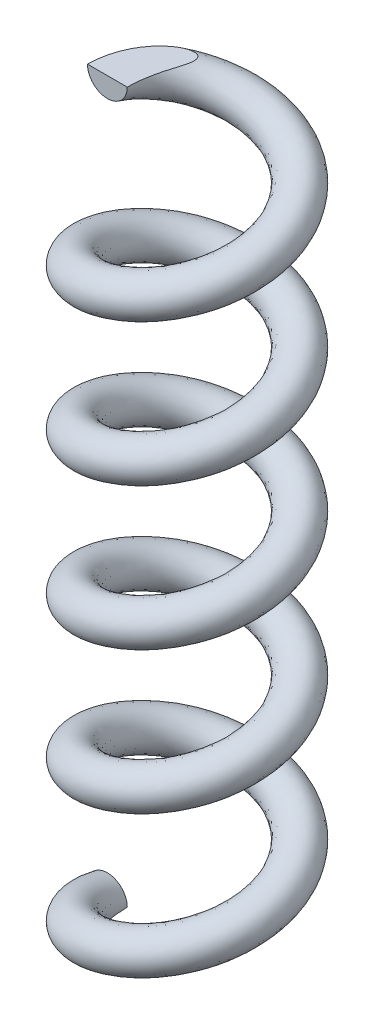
ISO-10303-21;
HEADER;
FILE_DESCRIPTION(('STEP AP214'),'2;1');
FILE_NAME('part.step','',(''),(''),'','','');
FILE_SCHEMA(('AUTOMOTIVE_DESIGN { 1 0 10303 214 1 1 1 1 }'));
ENDSEC;
DATA;
#1=APPLICATION_CONTEXT('core data for automotive mechanical design processes');
#2=APPLICATION_PROTOCOL_DEFINITION('international standard','automotive_design',2000,#1);
#3=PRODUCT_CONTEXT('',#1,'mechanical');
#4=PRODUCT('Part','Part','',(#3));
#5=PRODUCT_RELATED_PRODUCT_CATEGORY('part','',(#4));
#6=PRODUCT_DEFINITION_FORMATION('','',#4);
#7=PRODUCT_DEFINITION_CONTEXT('part definition',#1,'design');
#8=PRODUCT_DEFINITION('design','',#6,#7);
#9=PRODUCT_DEFINITION_SHAPE('','',#8);
#10=(LENGTH_UNIT() NAMED_UNIT(*) SI_UNIT(.MILLI.,.METRE.));
#11=(NAMED_UNIT(*) PLANE_ANGLE_UNIT() SI_UNIT($,.RADIAN.));
#12=(NAMED_UNIT(*) SI_UNIT($,.STERADIAN.) SOLID_ANGLE_UNIT());
#13=UNCERTAINTY_MEASURE_WITH_UNIT(LENGTH_MEASURE(1.E-05),#10,'distance_accuracy_value','');
#14=(GEOMETRIC_REPRESENTATION_CONTEXT(3) GLOBAL_UNCERTAINTY_ASSIGNED_CONTEXT((#13)) GLOBAL_UNIT_ASSIGNED_CONTEXT((#10,
#11,#12)) REPRESENTATION_CONTEXT('',''));
#15=CARTESIAN_POINT('',(0.,0.,0.));
#16=DIRECTION('',(0.,0.,1.));
#17=DIRECTION('',(1.,0.,0.));
#18=AXIS2_PLACEMENT_3D('',#15,#16,#17);
#19=CARTESIAN_POINT('',(-38.,53.3742096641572,9.77614774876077E-13));
#20=DIRECTION('',(0.,0.,1.));
#21=DIRECTION('',(1.,0.,0.));
#22=AXIS2_PLACEMENT_3D('',#19,#20,#21);
#23=PLANE('',#22);
#24=CARTESIAN_POINT('',(-38.,53.3742096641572,9.77614774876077E-13));
#25=DIRECTION('',(0.,0.,1.));
#26=DIRECTION('',(1.,0.,0.));
#27=AXIS2_PLACEMENT_3D('',#24,#25,#26);
#28=CIRCLE('',#27,3.5);
#29=CARTESIAN_POINT('',(-41.5,53.3742096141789,0.));
#30=VERTEX_POINT('',#29);
#31=CARTESIAN_POINT('',(-34.5,53.3742096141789,7.33211081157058E-13));
#32=VERTEX_POINT('',#31);
#33=EDGE_CURVE('E71',#30,#32,#28,.T.);
#34=ORIENTED_EDGE('',*,*,#33,.T.);
#35=DIRECTION('',(-1.,0.,0.));
#36=VECTOR('',#35,1.);
#37=CARTESIAN_POINT('',(-38.,53.3742096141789,9.77614774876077E-13));
#38=LINE('',#37,#36);
#39=EDGE_CURVE('E63',#32,#30,#38,.T.);
#40=ORIENTED_EDGE('',*,*,#39,.T.);
#41=EDGE_LOOP('',(#34,#40));
#42=FACE_BOUND('',#41,.T.);
#43=ADVANCED_FACE('F41',(#42),#23,.T.);
#44=CARTESIAN_POINT('',(-34.5,-71.5,0.));
#45=CARTESIAN_POINT('',(-34.5,-70.2512579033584,3.41165681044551));
#46=CARTESIAN_POINT('',(-32.4946784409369,-69.0025158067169,6.17174514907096));
#47=CARTESIAN_POINT('',(-30.4893568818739,-67.7537737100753,8.93183348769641));
#48=CARTESIAN_POINT('',(-27.2446784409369,-66.5050316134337,9.98609342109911));
#49=CARTESIAN_POINT('',(-24.,-65.2562895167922,11.0403533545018));
#50=CARTESIAN_POINT('',(-20.7553215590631,-64.0075474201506,9.98609342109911));
#51=CARTESIAN_POINT('',(-17.5106431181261,-62.758805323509,8.93183348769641));
#52=CARTESIAN_POINT('',(-15.5053215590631,-61.5100632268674,6.17174514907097));
#53=CARTESIAN_POINT('',(-13.5,-60.2613211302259,3.41165681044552));
#54=CARTESIAN_POINT('',(-13.5,-59.0125790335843,0.));
#55=CARTESIAN_POINT('',(-13.5,-57.7638369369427,-3.41165681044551));
#56=CARTESIAN_POINT('',(-15.5053215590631,-56.5150948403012,-6.17174514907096));
#57=CARTESIAN_POINT('',(-17.5106431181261,-55.2663527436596,-8.93183348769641));
#58=CARTESIAN_POINT('',(-20.7553215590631,-54.017610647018,-9.98609342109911));
#59=CARTESIAN_POINT('',(-24.,-52.7688685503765,-11.0403533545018));
#60=CARTESIAN_POINT('',(-27.2446784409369,-51.5201264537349,-9.98609342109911));
#61=CARTESIAN_POINT('',(-30.4893568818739,-50.2713843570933,-8.93183348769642));
#62=CARTESIAN_POINT('',(-32.4946784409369,-49.0226422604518,-6.17174514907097));
#63=CARTESIAN_POINT('',(-34.5,-47.7739001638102,-3.41165681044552));
#64=CARTESIAN_POINT('',(-34.5,-46.5251580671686,0.));
#65=CARTESIAN_POINT('',(-34.5,-45.2764159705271,3.41165681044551));
#66=CARTESIAN_POINT('',(-32.4946784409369,-44.0276738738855,6.17174514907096));
#67=CARTESIAN_POINT('',(-30.4893568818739,-42.7789317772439,8.93183348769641));
#68=CARTESIAN_POINT('',(-27.2446784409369,-41.5301896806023,9.98609342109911));
#69=CARTESIAN_POINT('',(-24.,-40.2814475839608,11.0403533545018));
#70=CARTESIAN_POINT('',(-20.7553215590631,-39.0327054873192,9.98609342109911));
#71=CARTESIAN_POINT('',(-17.5106431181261,-37.7839633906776,8.93183348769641));
#72=CARTESIAN_POINT('',(-15.5053215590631,-36.5352212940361,6.17174514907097));
#73=CARTESIAN_POINT('',(-13.5,-35.2864791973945,3.41165681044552));
#74=CARTESIAN_POINT('',(-13.5,-34.0377371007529,0.));
#75=CARTESIAN_POINT('',(-13.5,-32.7889950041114,-3.41165681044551));
#76=CARTESIAN_POINT('',(-15.5053215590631,-31.5402529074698,-6.17174514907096));
#77=CARTESIAN_POINT('',(-17.5106431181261,-30.2915108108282,-8.93183348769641));
#78=CARTESIAN_POINT('',(-20.7553215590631,-29.0427687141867,-9.98609342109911));
#79=CARTESIAN_POINT('',(-24.,-27.7940266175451,-11.0403533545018));
#80=CARTESIAN_POINT('',(-27.2446784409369,-26.5452845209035,-9.98609342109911));
#81=CARTESIAN_POINT('',(-30.4893568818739,-25.296542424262,-8.93183348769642));
#82=CARTESIAN_POINT('',(-32.4946784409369,-24.0478003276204,-6.17174514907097));
#83=CARTESIAN_POINT('',(-34.5,-22.7990582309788,-3.41165681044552));
#84=CARTESIAN_POINT('',(-34.5,-21.5503161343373,0.));
#85=CARTESIAN_POINT('',(-34.5,-20.3015740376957,3.41165681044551));
#86=CARTESIAN_POINT('',(-32.4946784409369,-19.0528319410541,6.17174514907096));
#87=CARTESIAN_POINT('',(-30.4893568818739,-17.8040898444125,8.93183348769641));
#88=CARTESIAN_POINT('',(-27.2446784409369,-16.555347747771,9.98609342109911));
#89=CARTESIAN_POINT('',(-24.,-15.3066056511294,11.0403533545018));
#90=CARTESIAN_POINT('',(-20.7553215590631,-14.0578635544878,9.98609342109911));
#91=CARTESIAN_POINT('',(-17.5106431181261,-12.8091214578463,8.93183348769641));
#92=CARTESIAN_POINT('',(-15.5053215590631,-11.5603793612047,6.17174514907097));
#93=CARTESIAN_POINT('',(-13.5,-10.3116372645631,3.41165681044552));
#94=CARTESIAN_POINT('',(-13.5,-9.06289516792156,0.));
#95=CARTESIAN_POINT('',(-13.5,-7.81415307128,-3.41165681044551));
#96=CARTESIAN_POINT('',(-15.5053215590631,-6.56541097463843,-6.17174514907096));
#97=CARTESIAN_POINT('',(-17.5106431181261,-5.31666887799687,-8.93183348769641));
#98=CARTESIAN_POINT('',(-20.7553215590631,-4.06792678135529,-9.98609342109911));
#99=CARTESIAN_POINT('',(-24.,-2.81918468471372,-11.0403533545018));
#100=CARTESIAN_POINT('',(-27.2446784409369,-1.57044258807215,-9.98609342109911));
#101=CARTESIAN_POINT('',(-30.4893568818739,-0.321700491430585,-8.93183348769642));
#102=CARTESIAN_POINT('',(-32.4946784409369,0.927041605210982,-6.17174514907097));
#103=CARTESIAN_POINT('',(-34.5,2.17578370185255,-3.41165681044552));
#104=CARTESIAN_POINT('',(-34.5,3.42452579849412,0.));
#105=CARTESIAN_POINT('',(-34.5,4.6732678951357,3.41165681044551));
#106=CARTESIAN_POINT('',(-32.4946784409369,5.92200999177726,6.17174514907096));
#107=CARTESIAN_POINT('',(-30.4893568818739,7.17075208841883,8.93183348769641));
#108=CARTESIAN_POINT('',(-27.2446784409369,8.4194941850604,9.98609342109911));
#109=CARTESIAN_POINT('',(-24.,9.66823628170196,11.0403533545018));
#110=CARTESIAN_POINT('',(-20.7553215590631,10.9169783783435,9.98609342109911));
#111=CARTESIAN_POINT('',(-17.5106431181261,12.1657204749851,8.93183348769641));
#112=CARTESIAN_POINT('',(-15.5053215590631,13.4144625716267,6.17174514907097));
#113=CARTESIAN_POINT('',(-13.5,14.6632046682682,3.41165681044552));
#114=CARTESIAN_POINT('',(-13.5,15.9119467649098,0.));
#115=CARTESIAN_POINT('',(-13.5,17.1606888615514,-3.41165681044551));
#116=CARTESIAN_POINT('',(-15.5053215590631,18.4094309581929,-6.17174514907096));
#117=CARTESIAN_POINT('',(-17.5106431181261,19.6581730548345,-8.93183348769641));
#118=CARTESIAN_POINT('',(-20.7553215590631,20.9069151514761,-9.98609342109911));
#119=CARTESIAN_POINT('',(-24.,22.1556572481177,-11.0403533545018));
#120=CARTESIAN_POINT('',(-27.2446784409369,23.4043993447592,-9.98609342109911));
#121=CARTESIAN_POINT('',(-30.4893568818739,24.6531414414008,-8.93183348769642));
#122=CARTESIAN_POINT('',(-32.4946784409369,25.9018835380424,-6.17174514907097));
#123=CARTESIAN_POINT('',(-34.5,27.1506256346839,-3.41165681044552));
#124=CARTESIAN_POINT('',(-34.5,28.3993677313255,0.));
#125=CARTESIAN_POINT('',(-34.5,29.6481098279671,3.41165681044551));
#126=CARTESIAN_POINT('',(-32.4946784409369,30.8968519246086,6.17174514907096));
#127=CARTESIAN_POINT('',(-30.4893568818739,32.1455940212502,8.93183348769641));
#128=CARTESIAN_POINT('',(-27.2446784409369,33.3943361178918,9.98609342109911));
#129=CARTESIAN_POINT('',(-24.,34.6430782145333,11.0403533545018));
#130=CARTESIAN_POINT('',(-20.7553215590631,35.8918203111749,9.98609342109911));
#131=CARTESIAN_POINT('',(-17.5106431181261,37.1405624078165,8.93183348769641));
#132=CARTESIAN_POINT('',(-15.5053215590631,38.389304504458,6.17174514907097));
#133=CARTESIAN_POINT('',(-13.5,39.6380466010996,3.41165681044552));
#134=CARTESIAN_POINT('',(-13.5,40.8867886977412,0.));
#135=CARTESIAN_POINT('',(-13.5,42.1355307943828,-3.41165681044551));
#136=CARTESIAN_POINT('',(-15.5053215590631,43.3842728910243,-6.17174514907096));
#137=CARTESIAN_POINT('',(-17.5106431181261,44.6330149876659,-8.93183348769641));
#138=CARTESIAN_POINT('',(-20.7553215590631,45.8817570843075,-9.98609342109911));
#139=CARTESIAN_POINT('',(-24.,47.130499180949,-11.0403533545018));
#140=CARTESIAN_POINT('',(-27.2446784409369,48.3792412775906,-9.98609342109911));
#141=CARTESIAN_POINT('',(-30.4893568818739,49.6279833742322,-8.93183348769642));
#142=CARTESIAN_POINT('',(-32.4946784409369,50.8767254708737,-6.17174514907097));
#143=CARTESIAN_POINT('',(-34.5,52.1254675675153,-3.41165681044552));
#144=CARTESIAN_POINT('',(-34.5,53.3742096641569,0.));
#145=CARTESIAN_POINT('',(-34.5,-64.5,0.));
#146=CARTESIAN_POINT('',(-34.5,-63.2512579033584,3.41165681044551));
#147=CARTESIAN_POINT('',(-32.4946784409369,-62.0025158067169,6.17174514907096));
#148=CARTESIAN_POINT('',(-30.4893568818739,-60.7537737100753,8.93183348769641));
#149=CARTESIAN_POINT('',(-27.2446784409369,-59.5050316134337,9.98609342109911));
#150=CARTESIAN_POINT('',(-24.,-58.2562895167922,11.0403533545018));
#151=CARTESIAN_POINT('',(-20.7553215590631,-57.0075474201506,9.98609342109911));
#152=CARTESIAN_POINT('',(-17.5106431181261,-55.758805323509,8.93183348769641));
#153=CARTESIAN_POINT('',(-15.5053215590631,-54.5100632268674,6.17174514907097));
#154=CARTESIAN_POINT('',(-13.5,-53.2613211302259,3.41165681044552));
#155=CARTESIAN_POINT('',(-13.5,-52.0125790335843,0.));
#156=CARTESIAN_POINT('',(-13.5,-50.7638369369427,-3.41165681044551));
#157=CARTESIAN_POINT('',(-15.5053215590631,-49.5150948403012,-6.17174514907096));
#158=CARTESIAN_POINT('',(-17.5106431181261,-48.2663527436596,-8.93183348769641));
#159=CARTESIAN_POINT('',(-20.7553215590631,-47.017610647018,-9.98609342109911));
#160=CARTESIAN_POINT('',(-24.,-45.7688685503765,-11.0403533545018));
#161=CARTESIAN_POINT('',(-27.2446784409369,-44.5201264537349,-9.98609342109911));
#162=CARTESIAN_POINT('',(-30.4893568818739,-43.2713843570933,-8.93183348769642));
#163=CARTESIAN_POINT('',(-32.4946784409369,-42.0226422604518,-6.17174514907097));
#164=CARTESIAN_POINT('',(-34.5,-40.7739001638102,-3.41165681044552));
#165=CARTESIAN_POINT('',(-34.5,-39.5251580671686,0.));
#166=CARTESIAN_POINT('',(-34.5,-38.276415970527,3.41165681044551));
#167=CARTESIAN_POINT('',(-32.4946784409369,-37.0276738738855,6.17174514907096));
#168=CARTESIAN_POINT('',(-30.4893568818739,-35.7789317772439,8.93183348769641));
#169=CARTESIAN_POINT('',(-27.2446784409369,-34.5301896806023,9.98609342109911));
#170=CARTESIAN_POINT('',(-24.,-33.2814475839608,11.0403533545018));
#171=CARTESIAN_POINT('',(-20.7553215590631,-32.0327054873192,9.98609342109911));
#172=CARTESIAN_POINT('',(-17.5106431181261,-30.7839633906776,8.93183348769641));
#173=CARTESIAN_POINT('',(-15.5053215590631,-29.5352212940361,6.17174514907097));
#174=CARTESIAN_POINT('',(-13.5,-28.2864791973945,3.41165681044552));
#175=CARTESIAN_POINT('',(-13.5,-27.0377371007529,0.));
#176=CARTESIAN_POINT('',(-13.5,-25.7889950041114,-3.41165681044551));
#177=CARTESIAN_POINT('',(-15.5053215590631,-24.5402529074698,-6.17174514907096));
#178=CARTESIAN_POINT('',(-17.5106431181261,-23.2915108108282,-8.93183348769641));
#179=CARTESIAN_POINT('',(-20.7553215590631,-22.0427687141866,-9.98609342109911));
#180=CARTESIAN_POINT('',(-24.,-20.7940266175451,-11.0403533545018));
#181=CARTESIAN_POINT('',(-27.2446784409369,-19.5452845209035,-9.98609342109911));
#182=CARTESIAN_POINT('',(-30.4893568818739,-18.296542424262,-8.93183348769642));
#183=CARTESIAN_POINT('',(-32.4946784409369,-17.0478003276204,-6.17174514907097));
#184=CARTESIAN_POINT('',(-34.5,-15.7990582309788,-3.41165681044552));
#185=CARTESIAN_POINT('',(-34.5,-14.5503161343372,0.));
#186=CARTESIAN_POINT('',(-34.5,-13.3015740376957,3.41165681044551));
#187=CARTESIAN_POINT('',(-32.4946784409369,-12.0528319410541,6.17174514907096));
#188=CARTESIAN_POINT('',(-30.4893568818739,-10.8040898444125,8.93183348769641));
#189=CARTESIAN_POINT('',(-27.2446784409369,-9.55534774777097,9.98609342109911));
#190=CARTESIAN_POINT('',(-24.,-8.3066056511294,11.0403533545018));
#191=CARTESIAN_POINT('',(-20.7553215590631,-7.05786355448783,9.98609342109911));
#192=CARTESIAN_POINT('',(-17.5106431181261,-5.80912145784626,8.93183348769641));
#193=CARTESIAN_POINT('',(-15.5053215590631,-4.56037936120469,6.17174514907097));
#194=CARTESIAN_POINT('',(-13.5,-3.31163726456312,3.41165681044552));
#195=CARTESIAN_POINT('',(-13.5,-2.06289516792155,0.));
#196=CARTESIAN_POINT('',(-13.5,-0.814153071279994,-3.41165681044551));
#197=CARTESIAN_POINT('',(-15.5053215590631,0.434589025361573,-6.17174514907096));
#198=CARTESIAN_POINT('',(-17.5106431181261,1.68333112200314,-8.93183348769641));
#199=CARTESIAN_POINT('',(-20.7553215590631,2.93207321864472,-9.98609342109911));
#200=CARTESIAN_POINT('',(-24.,4.18081531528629,-11.0403533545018));
#201=CARTESIAN_POINT('',(-27.2446784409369,5.42955741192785,-9.98609342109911));
#202=CARTESIAN_POINT('',(-30.4893568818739,6.67829950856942,-8.93183348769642));
#203=CARTESIAN_POINT('',(-32.4946784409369,7.92704160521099,-6.17174514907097));
#204=CARTESIAN_POINT('',(-34.5,9.17578370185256,-3.41165681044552));
#205=CARTESIAN_POINT('',(-34.5,10.4245257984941,0.));
#206=CARTESIAN_POINT('',(-34.5,11.6732678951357,3.41165681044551));
#207=CARTESIAN_POINT('',(-32.4946784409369,12.9220099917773,6.17174514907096));
#208=CARTESIAN_POINT('',(-30.4893568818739,14.1707520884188,8.93183348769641));
#209=CARTESIAN_POINT('',(-27.2446784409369,15.4194941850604,9.98609342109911));
#210=CARTESIAN_POINT('',(-24.,16.668236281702,11.0403533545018));
#211=CARTESIAN_POINT('',(-20.7553215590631,17.9169783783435,9.98609342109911));
#212=CARTESIAN_POINT('',(-17.5106431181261,19.1657204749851,8.93183348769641));
#213=CARTESIAN_POINT('',(-15.5053215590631,20.4144625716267,6.17174514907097));
#214=CARTESIAN_POINT('',(-13.5,21.6632046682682,3.41165681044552));
#215=CARTESIAN_POINT('',(-13.5,22.9119467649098,0.));
#216=CARTESIAN_POINT('',(-13.5,24.1606888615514,-3.41165681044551));
#217=CARTESIAN_POINT('',(-15.5053215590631,25.409430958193,-6.17174514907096));
#218=CARTESIAN_POINT('',(-17.5106431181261,26.6581730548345,-8.93183348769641));
#219=CARTESIAN_POINT('',(-20.7553215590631,27.9069151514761,-9.98609342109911));
#220=CARTESIAN_POINT('',(-24.,29.1556572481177,-11.0403533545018));
#221=CARTESIAN_POINT('',(-27.2446784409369,30.4043993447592,-9.98609342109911));
#222=CARTESIAN_POINT('',(-30.4893568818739,31.6531414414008,-8.93183348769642));
#223=CARTESIAN_POINT('',(-32.4946784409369,32.9018835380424,-6.17174514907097));
#224=CARTESIAN_POINT('',(-34.5,34.1506256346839,-3.41165681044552));
#225=CARTESIAN_POINT('',(-34.5,35.3993677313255,0.));
#226=CARTESIAN_POINT('',(-34.5,36.6481098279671,3.41165681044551));
#227=CARTESIAN_POINT('',(-32.4946784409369,37.8968519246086,6.17174514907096));
#228=CARTESIAN_POINT('',(-30.4893568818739,39.1455940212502,8.93183348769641));
#229=CARTESIAN_POINT('',(-27.2446784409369,40.3943361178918,9.98609342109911));
#230=CARTESIAN_POINT('',(-24.,41.6430782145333,11.0403533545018));
#231=CARTESIAN_POINT('',(-20.7553215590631,42.8918203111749,9.98609342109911));
#232=CARTESIAN_POINT('',(-17.5106431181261,44.1405624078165,8.93183348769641));
#233=CARTESIAN_POINT('',(-15.5053215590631,45.3893045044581,6.17174514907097));
#234=CARTESIAN_POINT('',(-13.5,46.6380466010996,3.41165681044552));
#235=CARTESIAN_POINT('',(-13.5,47.8867886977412,0.));
#236=CARTESIAN_POINT('',(-13.5,49.1355307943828,-3.41165681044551));
#237=CARTESIAN_POINT('',(-15.5053215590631,50.3842728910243,-6.17174514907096));
#238=CARTESIAN_POINT('',(-17.5106431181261,51.6330149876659,-8.93183348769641));
#239=CARTESIAN_POINT('',(-20.7553215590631,52.8817570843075,-9.98609342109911));
#240=CARTESIAN_POINT('',(-24.,54.130499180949,-11.0403533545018));
#241=CARTESIAN_POINT('',(-27.2446784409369,55.3792412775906,-9.98609342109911));
#242=CARTESIAN_POINT('',(-30.4893568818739,56.6279833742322,-8.93183348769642));
#243=CARTESIAN_POINT('',(-32.4946784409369,57.8767254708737,-6.17174514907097));
#244=CARTESIAN_POINT('',(-34.5,59.1254675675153,-3.41165681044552));
#245=CARTESIAN_POINT('',(-34.5,60.3742096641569,0.));
#246=CARTESIAN_POINT('',(-41.5,-64.5,0.));
#247=CARTESIAN_POINT('',(-41.5,-63.2512579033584,5.68609468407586));
#248=CARTESIAN_POINT('',(-38.1577974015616,-62.0025158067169,10.2862419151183));
#249=CARTESIAN_POINT('',(-34.8155948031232,-60.7537737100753,14.8863891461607));
#250=CARTESIAN_POINT('',(-29.4077974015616,-59.5050316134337,16.6434890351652));
#251=CARTESIAN_POINT('',(-24.,-58.2562895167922,18.4005889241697));
#252=CARTESIAN_POINT('',(-18.5922025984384,-57.0075474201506,16.6434890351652));
#253=CARTESIAN_POINT('',(-13.1844051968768,-55.758805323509,14.8863891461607));
#254=CARTESIAN_POINT('',(-9.84220259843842,-54.5100632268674,10.2862419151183));
#255=CARTESIAN_POINT('',(-6.5,-53.2613211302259,5.68609468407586));
#256=CARTESIAN_POINT('',(-6.5,-52.0125790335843,0.));
#257=CARTESIAN_POINT('',(-6.5,-50.7638369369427,-5.68609468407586));
#258=CARTESIAN_POINT('',(-9.84220259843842,-49.5150948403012,-10.2862419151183));
#259=CARTESIAN_POINT('',(-13.1844051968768,-48.2663527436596,-14.8863891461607));
#260=CARTESIAN_POINT('',(-18.5922025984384,-47.017610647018,-16.6434890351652));
#261=CARTESIAN_POINT('',(-24.,-45.7688685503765,-18.4005889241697));
#262=CARTESIAN_POINT('',(-29.4077974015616,-44.5201264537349,-16.6434890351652));
#263=CARTESIAN_POINT('',(-34.8155948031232,-43.2713843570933,-14.8863891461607));
#264=CARTESIAN_POINT('',(-38.1577974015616,-42.0226422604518,-10.2862419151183));
#265=CARTESIAN_POINT('',(-41.5,-40.7739001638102,-5.68609468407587));
#266=CARTESIAN_POINT('',(-41.5,-39.5251580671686,0.));
#267=CARTESIAN_POINT('',(-41.5,-38.276415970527,5.68609468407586));
#268=CARTESIAN_POINT('',(-38.1577974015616,-37.0276738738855,10.2862419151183));
#269=CARTESIAN_POINT('',(-34.8155948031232,-35.7789317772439,14.8863891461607));
#270=CARTESIAN_POINT('',(-29.4077974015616,-34.5301896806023,16.6434890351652));
#271=CARTESIAN_POINT('',(-24.,-33.2814475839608,18.4005889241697));
#272=CARTESIAN_POINT('',(-18.5922025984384,-32.0327054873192,16.6434890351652));
#273=CARTESIAN_POINT('',(-13.1844051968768,-30.7839633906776,14.8863891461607));
#274=CARTESIAN_POINT('',(-9.84220259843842,-29.5352212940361,10.2862419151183));
#275=CARTESIAN_POINT('',(-6.5,-28.2864791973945,5.68609468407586));
#276=CARTESIAN_POINT('',(-6.5,-27.0377371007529,0.));
#277=CARTESIAN_POINT('',(-6.5,-25.7889950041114,-5.68609468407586));
#278=CARTESIAN_POINT('',(-9.84220259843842,-24.5402529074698,-10.2862419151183));
#279=CARTESIAN_POINT('',(-13.1844051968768,-23.2915108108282,-14.8863891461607));
#280=CARTESIAN_POINT('',(-18.5922025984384,-22.0427687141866,-16.6434890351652));
#281=CARTESIAN_POINT('',(-24.,-20.7940266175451,-18.4005889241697));
#282=CARTESIAN_POINT('',(-29.4077974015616,-19.5452845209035,-16.6434890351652));
#283=CARTESIAN_POINT('',(-34.8155948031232,-18.296542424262,-14.8863891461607));
#284=CARTESIAN_POINT('',(-38.1577974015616,-17.0478003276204,-10.2862419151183));
#285=CARTESIAN_POINT('',(-41.5,-15.7990582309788,-5.68609468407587));
#286=CARTESIAN_POINT('',(-41.5,-14.5503161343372,0.));
#287=CARTESIAN_POINT('',(-41.5,-13.3015740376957,5.68609468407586));
#288=CARTESIAN_POINT('',(-38.1577974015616,-12.0528319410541,10.2862419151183));
#289=CARTESIAN_POINT('',(-34.8155948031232,-10.8040898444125,14.8863891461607));
#290=CARTESIAN_POINT('',(-29.4077974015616,-9.55534774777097,16.6434890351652));
#291=CARTESIAN_POINT('',(-24.,-8.3066056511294,18.4005889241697));
#292=CARTESIAN_POINT('',(-18.5922025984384,-7.05786355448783,16.6434890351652));
#293=CARTESIAN_POINT('',(-13.1844051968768,-5.80912145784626,14.8863891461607));
#294=CARTESIAN_POINT('',(-9.84220259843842,-4.56037936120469,10.2862419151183));
#295=CARTESIAN_POINT('',(-6.5,-3.31163726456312,5.68609468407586));
#296=CARTESIAN_POINT('',(-6.5,-2.06289516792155,0.));
#297=CARTESIAN_POINT('',(-6.5,-0.814153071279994,-5.68609468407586));
#298=CARTESIAN_POINT('',(-9.84220259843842,0.434589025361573,-10.2862419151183));
#299=CARTESIAN_POINT('',(-13.1844051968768,1.68333112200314,-14.8863891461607));
#300=CARTESIAN_POINT('',(-18.5922025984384,2.93207321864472,-16.6434890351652));
#301=CARTESIAN_POINT('',(-24.,4.18081531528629,-18.4005889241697));
#302=CARTESIAN_POINT('',(-29.4077974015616,5.42955741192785,-16.6434890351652));
#303=CARTESIAN_POINT('',(-34.8155948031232,6.67829950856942,-14.8863891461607));
#304=CARTESIAN_POINT('',(-38.1577974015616,7.92704160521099,-10.2862419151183));
#305=CARTESIAN_POINT('',(-41.5,9.17578370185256,-5.68609468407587));
#306=CARTESIAN_POINT('',(-41.5,10.4245257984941,0.));
#307=CARTESIAN_POINT('',(-41.5,11.6732678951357,5.68609468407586));
#308=CARTESIAN_POINT('',(-38.1577974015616,12.9220099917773,10.2862419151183));
#309=CARTESIAN_POINT('',(-34.8155948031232,14.1707520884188,14.8863891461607));
#310=CARTESIAN_POINT('',(-29.4077974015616,15.4194941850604,16.6434890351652));
#311=CARTESIAN_POINT('',(-24.,16.668236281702,18.4005889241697));
#312=CARTESIAN_POINT('',(-18.5922025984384,17.9169783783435,16.6434890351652));
#313=CARTESIAN_POINT('',(-13.1844051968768,19.1657204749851,14.8863891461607));
#314=CARTESIAN_POINT('',(-9.84220259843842,20.4144625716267,10.2862419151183));
#315=CARTESIAN_POINT('',(-6.5,21.6632046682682,5.68609468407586));
#316=CARTESIAN_POINT('',(-6.5,22.9119467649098,0.));
#317=CARTESIAN_POINT('',(-6.5,24.1606888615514,-5.68609468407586));
#318=CARTESIAN_POINT('',(-9.84220259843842,25.409430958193,-10.2862419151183));
#319=CARTESIAN_POINT('',(-13.1844051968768,26.6581730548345,-14.8863891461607));
#320=CARTESIAN_POINT('',(-18.5922025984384,27.9069151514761,-16.6434890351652));
#321=CARTESIAN_POINT('',(-24.,29.1556572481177,-18.4005889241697));
#322=CARTESIAN_POINT('',(-29.4077974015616,30.4043993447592,-16.6434890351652));
#323=CARTESIAN_POINT('',(-34.8155948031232,31.6531414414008,-14.8863891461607));
#324=CARTESIAN_POINT('',(-38.1577974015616,32.9018835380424,-10.2862419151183));
#325=CARTESIAN_POINT('',(-41.5,34.1506256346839,-5.68609468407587));
#326=CARTESIAN_POINT('',(-41.5,35.3993677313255,0.));
#327=CARTESIAN_POINT('',(-41.5,36.6481098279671,5.68609468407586));
#328=CARTESIAN_POINT('',(-38.1577974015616,37.8968519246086,10.2862419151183));
#329=CARTESIAN_POINT('',(-34.8155948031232,39.1455940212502,14.8863891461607));
#330=CARTESIAN_POINT('',(-29.4077974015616,40.3943361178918,16.6434890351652));
#331=CARTESIAN_POINT('',(-24.,41.6430782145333,18.4005889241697));
#332=CARTESIAN_POINT('',(-18.5922025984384,42.8918203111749,16.6434890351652));
#333=CARTESIAN_POINT('',(-13.1844051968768,44.1405624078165,14.8863891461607));
#334=CARTESIAN_POINT('',(-9.84220259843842,45.3893045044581,10.2862419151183));
#335=CARTESIAN_POINT('',(-6.5,46.6380466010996,5.68609468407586));
#336=CARTESIAN_POINT('',(-6.5,47.8867886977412,0.));
#337=CARTESIAN_POINT('',(-6.5,49.1355307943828,-5.68609468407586));
#338=CARTESIAN_POINT('',(-9.84220259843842,50.3842728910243,-10.2862419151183));
#339=CARTESIAN_POINT('',(-13.1844051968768,51.6330149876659,-14.8863891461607));
#340=CARTESIAN_POINT('',(-18.5922025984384,52.8817570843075,-16.6434890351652));
#341=CARTESIAN_POINT('',(-24.,54.130499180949,-18.4005889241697));
#342=CARTESIAN_POINT('',(-29.4077974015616,55.3792412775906,-16.6434890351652));
#343=CARTESIAN_POINT('',(-34.8155948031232,56.6279833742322,-14.8863891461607));
#344=CARTESIAN_POINT('',(-38.1577974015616,57.8767254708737,-10.2862419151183));
#345=CARTESIAN_POINT('',(-41.5,59.1254675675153,-5.68609468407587));
#346=CARTESIAN_POINT('',(-41.5,60.3742096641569,0.));
#347=CARTESIAN_POINT('',(-41.5,-71.5,0.));
#348=CARTESIAN_POINT('',(-41.5,-70.2512579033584,5.68609468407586));
#349=CARTESIAN_POINT('',(-38.1577974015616,-69.0025158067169,10.2862419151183));
#350=CARTESIAN_POINT('',(-34.8155948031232,-67.7537737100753,14.8863891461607));
#351=CARTESIAN_POINT('',(-29.4077974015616,-66.5050316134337,16.6434890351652));
#352=CARTESIAN_POINT('',(-24.,-65.2562895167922,18.4005889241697));
#353=CARTESIAN_POINT('',(-18.5922025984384,-64.0075474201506,16.6434890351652));
#354=CARTESIAN_POINT('',(-13.1844051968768,-62.758805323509,14.8863891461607));
#355=CARTESIAN_POINT('',(-9.84220259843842,-61.5100632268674,10.2862419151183));
#356=CARTESIAN_POINT('',(-6.5,-60.2613211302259,5.68609468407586));
#357=CARTESIAN_POINT('',(-6.5,-59.0125790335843,0.));
#358=CARTESIAN_POINT('',(-6.5,-57.7638369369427,-5.68609468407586));
#359=CARTESIAN_POINT('',(-9.84220259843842,-56.5150948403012,-10.2862419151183));
#360=CARTESIAN_POINT('',(-13.1844051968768,-55.2663527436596,-14.8863891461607));
#361=CARTESIAN_POINT('',(-18.5922025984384,-54.017610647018,-16.6434890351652));
#362=CARTESIAN_POINT('',(-24.,-52.7688685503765,-18.4005889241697));
#363=CARTESIAN_POINT('',(-29.4077974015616,-51.5201264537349,-16.6434890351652));
#364=CARTESIAN_POINT('',(-34.8155948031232,-50.2713843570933,-14.8863891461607));
#365=CARTESIAN_POINT('',(-38.1577974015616,-49.0226422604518,-10.2862419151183));
#366=CARTESIAN_POINT('',(-41.5,-47.7739001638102,-5.68609468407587));
#367=CARTESIAN_POINT('',(-41.5,-46.5251580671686,0.));
#368=CARTESIAN_POINT('',(-41.5,-45.2764159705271,5.68609468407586));
#369=CARTESIAN_POINT('',(-38.1577974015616,-44.0276738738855,10.2862419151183));
#370=CARTESIAN_POINT('',(-34.8155948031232,-42.7789317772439,14.8863891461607));
#371=CARTESIAN_POINT('',(-29.4077974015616,-41.5301896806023,16.6434890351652));
#372=CARTESIAN_POINT('',(-24.,-40.2814475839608,18.4005889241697));
#373=CARTESIAN_POINT('',(-18.5922025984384,-39.0327054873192,16.6434890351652));
#374=CARTESIAN_POINT('',(-13.1844051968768,-37.7839633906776,14.8863891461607));
#375=CARTESIAN_POINT('',(-9.84220259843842,-36.5352212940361,10.2862419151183));
#376=CARTESIAN_POINT('',(-6.5,-35.2864791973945,5.68609468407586));
#377=CARTESIAN_POINT('',(-6.5,-34.0377371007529,0.));
#378=CARTESIAN_POINT('',(-6.5,-32.7889950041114,-5.68609468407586));
#379=CARTESIAN_POINT('',(-9.84220259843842,-31.5402529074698,-10.2862419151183));
#380=CARTESIAN_POINT('',(-13.1844051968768,-30.2915108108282,-14.8863891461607));
#381=CARTESIAN_POINT('',(-18.5922025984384,-29.0427687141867,-16.6434890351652));
#382=CARTESIAN_POINT('',(-24.,-27.7940266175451,-18.4005889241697));
#383=CARTESIAN_POINT('',(-29.4077974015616,-26.5452845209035,-16.6434890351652));
#384=CARTESIAN_POINT('',(-34.8155948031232,-25.296542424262,-14.8863891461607));
#385=CARTESIAN_POINT('',(-38.1577974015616,-24.0478003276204,-10.2862419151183));
#386=CARTESIAN_POINT('',(-41.5,-22.7990582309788,-5.68609468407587));
#387=CARTESIAN_POINT('',(-41.5,-21.5503161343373,0.));
#388=CARTESIAN_POINT('',(-41.5,-20.3015740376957,5.68609468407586));
#389=CARTESIAN_POINT('',(-38.1577974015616,-19.0528319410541,10.2862419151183));
#390=CARTESIAN_POINT('',(-34.8155948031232,-17.8040898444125,14.8863891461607));
#391=CARTESIAN_POINT('',(-29.4077974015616,-16.555347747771,16.6434890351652));
#392=CARTESIAN_POINT('',(-24.,-15.3066056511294,18.4005889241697));
#393=CARTESIAN_POINT('',(-18.5922025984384,-14.0578635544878,16.6434890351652));
#394=CARTESIAN_POINT('',(-13.1844051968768,-12.8091214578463,14.8863891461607));
#395=CARTESIAN_POINT('',(-9.84220259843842,-11.5603793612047,10.2862419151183));
#396=CARTESIAN_POINT('',(-6.5,-10.3116372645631,5.68609468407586));
#397=CARTESIAN_POINT('',(-6.5,-9.06289516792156,0.));
#398=CARTESIAN_POINT('',(-6.5,-7.81415307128,-5.68609468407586));
#399=CARTESIAN_POINT('',(-9.84220259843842,-6.56541097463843,-10.2862419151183));
#400=CARTESIAN_POINT('',(-13.1844051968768,-5.31666887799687,-14.8863891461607));
#401=CARTESIAN_POINT('',(-18.5922025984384,-4.06792678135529,-16.6434890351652));
#402=CARTESIAN_POINT('',(-24.,-2.81918468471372,-18.4005889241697));
#403=CARTESIAN_POINT('',(-29.4077974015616,-1.57044258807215,-16.6434890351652));
#404=CARTESIAN_POINT('',(-34.8155948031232,-0.321700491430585,-14.8863891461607));
#405=CARTESIAN_POINT('',(-38.1577974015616,0.927041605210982,-10.2862419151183));
#406=CARTESIAN_POINT('',(-41.5,2.17578370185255,-5.68609468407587));
#407=CARTESIAN_POINT('',(-41.5,3.42452579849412,0.));
#408=CARTESIAN_POINT('',(-41.5,4.6732678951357,5.68609468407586));
#409=CARTESIAN_POINT('',(-38.1577974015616,5.92200999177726,10.2862419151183));
#410=CARTESIAN_POINT('',(-34.8155948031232,7.17075208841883,14.8863891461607));
#411=CARTESIAN_POINT('',(-29.4077974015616,8.4194941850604,16.6434890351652));
#412=CARTESIAN_POINT('',(-24.,9.66823628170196,18.4005889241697));
#413=CARTESIAN_POINT('',(-18.5922025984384,10.9169783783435,16.6434890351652));
#414=CARTESIAN_POINT('',(-13.1844051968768,12.1657204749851,14.8863891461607));
#415=CARTESIAN_POINT('',(-9.84220259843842,13.4144625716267,10.2862419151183));
#416=CARTESIAN_POINT('',(-6.5,14.6632046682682,5.68609468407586));
#417=CARTESIAN_POINT('',(-6.5,15.9119467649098,0.));
#418=CARTESIAN_POINT('',(-6.5,17.1606888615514,-5.68609468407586));
#419=CARTESIAN_POINT('',(-9.84220259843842,18.4094309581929,-10.2862419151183));
#420=CARTESIAN_POINT('',(-13.1844051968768,19.6581730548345,-14.8863891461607));
#421=CARTESIAN_POINT('',(-18.5922025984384,20.9069151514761,-16.6434890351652));
#422=CARTESIAN_POINT('',(-24.,22.1556572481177,-18.4005889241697));
#423=CARTESIAN_POINT('',(-29.4077974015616,23.4043993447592,-16.6434890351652));
#424=CARTESIAN_POINT('',(-34.8155948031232,24.6531414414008,-14.8863891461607));
#425=CARTESIAN_POINT('',(-38.1577974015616,25.9018835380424,-10.2862419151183));
#426=CARTESIAN_POINT('',(-41.5,27.1506256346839,-5.68609468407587));
#427=CARTESIAN_POINT('',(-41.5,28.3993677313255,0.));
#428=CARTESIAN_POINT('',(-41.5,29.6481098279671,5.68609468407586));
#429=CARTESIAN_POINT('',(-38.1577974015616,30.8968519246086,10.2862419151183));
#430=CARTESIAN_POINT('',(-34.8155948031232,32.1455940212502,14.8863891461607));
#431=CARTESIAN_POINT('',(-29.4077974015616,33.3943361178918,16.6434890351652));
#432=CARTESIAN_POINT('',(-24.,34.6430782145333,18.4005889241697));
#433=CARTESIAN_POINT('',(-18.5922025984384,35.8918203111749,16.6434890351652));
#434=CARTESIAN_POINT('',(-13.1844051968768,37.1405624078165,14.8863891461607));
#435=CARTESIAN_POINT('',(-9.84220259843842,38.389304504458,10.2862419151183));
#436=CARTESIAN_POINT('',(-6.5,39.6380466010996,5.68609468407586));
#437=CARTESIAN_POINT('',(-6.5,40.8867886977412,0.));
#438=CARTESIAN_POINT('',(-6.5,42.1355307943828,-5.68609468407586));
#439=CARTESIAN_POINT('',(-9.84220259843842,43.3842728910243,-10.2862419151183));
#440=CARTESIAN_POINT('',(-13.1844051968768,44.6330149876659,-14.8863891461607));
#441=CARTESIAN_POINT('',(-18.5922025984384,45.8817570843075,-16.6434890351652));
#442=CARTESIAN_POINT('',(-24.,47.130499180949,-18.4005889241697));
#443=CARTESIAN_POINT('',(-29.4077974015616,48.3792412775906,-16.6434890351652));
#444=CARTESIAN_POINT('',(-34.8155948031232,49.6279833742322,-14.8863891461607));
#445=CARTESIAN_POINT('',(-38.1577974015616,50.8767254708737,-10.2862419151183));
#446=CARTESIAN_POINT('',(-41.5,52.1254675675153,-5.68609468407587));
#447=CARTESIAN_POINT('',(-41.5,53.3742096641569,0.));
#448=CARTESIAN_POINT('',(-41.5,-78.5,0.));
#449=CARTESIAN_POINT('',(-41.5,-77.2512579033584,5.68609468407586));
#450=CARTESIAN_POINT('',(-38.1577974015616,-76.0025158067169,10.2862419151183));
#451=CARTESIAN_POINT('',(-34.8155948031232,-74.7537737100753,14.8863891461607));
#452=CARTESIAN_POINT('',(-29.4077974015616,-73.5050316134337,16.6434890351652));
#453=CARTESIAN_POINT('',(-24.,-72.2562895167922,18.4005889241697));
#454=CARTESIAN_POINT('',(-18.5922025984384,-71.0075474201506,16.6434890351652));
#455=CARTESIAN_POINT('',(-13.1844051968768,-69.758805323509,14.8863891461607));
#456=CARTESIAN_POINT('',(-9.84220259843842,-68.5100632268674,10.2862419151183));
#457=CARTESIAN_POINT('',(-6.5,-67.2613211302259,5.68609468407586));
#458=CARTESIAN_POINT('',(-6.5,-66.0125790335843,0.));
#459=CARTESIAN_POINT('',(-6.5,-64.7638369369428,-5.68609468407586));
#460=CARTESIAN_POINT('',(-9.84220259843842,-63.5150948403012,-10.2862419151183));
#461=CARTESIAN_POINT('',(-13.1844051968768,-62.2663527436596,-14.8863891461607));
#462=CARTESIAN_POINT('',(-18.5922025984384,-61.017610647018,-16.6434890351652));
#463=CARTESIAN_POINT('',(-24.,-59.7688685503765,-18.4005889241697));
#464=CARTESIAN_POINT('',(-29.4077974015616,-58.5201264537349,-16.6434890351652));
#465=CARTESIAN_POINT('',(-34.8155948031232,-57.2713843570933,-14.8863891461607));
#466=CARTESIAN_POINT('',(-38.1577974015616,-56.0226422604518,-10.2862419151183));
#467=CARTESIAN_POINT('',(-41.5,-54.7739001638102,-5.68609468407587));
#468=CARTESIAN_POINT('',(-41.5,-53.5251580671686,0.));
#469=CARTESIAN_POINT('',(-41.5,-52.276415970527,5.68609468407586));
#470=CARTESIAN_POINT('',(-38.1577974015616,-51.0276738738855,10.2862419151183));
#471=CARTESIAN_POINT('',(-34.8155948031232,-49.7789317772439,14.8863891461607));
#472=CARTESIAN_POINT('',(-29.4077974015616,-48.5301896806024,16.6434890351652));
#473=CARTESIAN_POINT('',(-24.,-47.2814475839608,18.4005889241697));
#474=CARTESIAN_POINT('',(-18.5922025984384,-46.0327054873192,16.6434890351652));
#475=CARTESIAN_POINT('',(-13.1844051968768,-44.7839633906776,14.8863891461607));
#476=CARTESIAN_POINT('',(-9.84220259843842,-43.5352212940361,10.2862419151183));
#477=CARTESIAN_POINT('',(-6.5,-42.2864791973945,5.68609468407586));
#478=CARTESIAN_POINT('',(-6.5,-41.0377371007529,0.));
#479=CARTESIAN_POINT('',(-6.5,-39.7889950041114,-5.68609468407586));
#480=CARTESIAN_POINT('',(-9.84220259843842,-38.5402529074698,-10.2862419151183));
#481=CARTESIAN_POINT('',(-13.1844051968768,-37.2915108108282,-14.8863891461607));
#482=CARTESIAN_POINT('',(-18.5922025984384,-36.0427687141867,-16.6434890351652));
#483=CARTESIAN_POINT('',(-24.,-34.7940266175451,-18.4005889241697));
#484=CARTESIAN_POINT('',(-29.4077974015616,-33.5452845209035,-16.6434890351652));
#485=CARTESIAN_POINT('',(-34.8155948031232,-32.296542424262,-14.8863891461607));
#486=CARTESIAN_POINT('',(-38.1577974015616,-31.0478003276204,-10.2862419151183));
#487=CARTESIAN_POINT('',(-41.5,-29.7990582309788,-5.68609468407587));
#488=CARTESIAN_POINT('',(-41.5,-28.5503161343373,0.));
#489=CARTESIAN_POINT('',(-41.5,-27.3015740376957,5.68609468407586));
#490=CARTESIAN_POINT('',(-38.1577974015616,-26.0528319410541,10.2862419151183));
#491=CARTESIAN_POINT('',(-34.8155948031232,-24.8040898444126,14.8863891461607));
#492=CARTESIAN_POINT('',(-29.4077974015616,-23.555347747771,16.6434890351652));
#493=CARTESIAN_POINT('',(-24.,-22.3066056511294,18.4005889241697));
#494=CARTESIAN_POINT('',(-18.5922025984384,-21.0578635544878,16.6434890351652));
#495=CARTESIAN_POINT('',(-13.1844051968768,-19.8091214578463,14.8863891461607));
#496=CARTESIAN_POINT('',(-9.84220259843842,-18.5603793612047,10.2862419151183));
#497=CARTESIAN_POINT('',(-6.5,-17.3116372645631,5.68609468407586));
#498=CARTESIAN_POINT('',(-6.5,-16.0628951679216,0.));
#499=CARTESIAN_POINT('',(-6.5,-14.81415307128,-5.68609468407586));
#500=CARTESIAN_POINT('',(-9.84220259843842,-13.5654109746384,-10.2862419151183));
#501=CARTESIAN_POINT('',(-13.1844051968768,-12.3166688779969,-14.8863891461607));
#502=CARTESIAN_POINT('',(-18.5922025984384,-11.0679267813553,-16.6434890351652));
#503=CARTESIAN_POINT('',(-24.,-9.81918468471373,-18.4005889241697));
#504=CARTESIAN_POINT('',(-29.4077974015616,-8.57044258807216,-16.6434890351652));
#505=CARTESIAN_POINT('',(-34.8155948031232,-7.32170049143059,-14.8863891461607));
#506=CARTESIAN_POINT('',(-38.1577974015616,-6.07295839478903,-10.2862419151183));
#507=CARTESIAN_POINT('',(-41.5,-4.82421629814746,-5.68609468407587));
#508=CARTESIAN_POINT('',(-41.5,-3.57547420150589,0.));
#509=CARTESIAN_POINT('',(-41.5,-2.32673210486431,5.68609468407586));
#510=CARTESIAN_POINT('',(-38.1577974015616,-1.07799000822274,10.2862419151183));
#511=CARTESIAN_POINT('',(-34.8155948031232,0.170752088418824,14.8863891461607));
#512=CARTESIAN_POINT('',(-29.4077974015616,1.41949418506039,16.6434890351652));
#513=CARTESIAN_POINT('',(-24.,2.66823628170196,18.4005889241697));
#514=CARTESIAN_POINT('',(-18.5922025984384,3.91697837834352,16.6434890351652));
#515=CARTESIAN_POINT('',(-13.1844051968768,5.16572047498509,14.8863891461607));
#516=CARTESIAN_POINT('',(-9.84220259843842,6.41446257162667,10.2862419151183));
#517=CARTESIAN_POINT('',(-6.5,7.66320466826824,5.68609468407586));
#518=CARTESIAN_POINT('',(-6.5,8.91194676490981,0.));
#519=CARTESIAN_POINT('',(-6.5,10.1606888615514,-5.68609468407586));
#520=CARTESIAN_POINT('',(-9.84220259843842,11.4094309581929,-10.2862419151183));
#521=CARTESIAN_POINT('',(-13.1844051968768,12.6581730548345,-14.8863891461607));
#522=CARTESIAN_POINT('',(-18.5922025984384,13.9069151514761,-16.6434890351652));
#523=CARTESIAN_POINT('',(-24.,15.1556572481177,-18.4005889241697));
#524=CARTESIAN_POINT('',(-29.4077974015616,16.4043993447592,-16.6434890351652));
#525=CARTESIAN_POINT('',(-34.8155948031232,17.6531414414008,-14.8863891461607));
#526=CARTESIAN_POINT('',(-38.1577974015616,18.9018835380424,-10.2862419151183));
#527=CARTESIAN_POINT('',(-41.5,20.1506256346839,-5.68609468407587));
#528=CARTESIAN_POINT('',(-41.5,21.3993677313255,0.));
#529=CARTESIAN_POINT('',(-41.5,22.6481098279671,5.68609468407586));
#530=CARTESIAN_POINT('',(-38.1577974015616,23.8968519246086,10.2862419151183));
#531=CARTESIAN_POINT('',(-34.8155948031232,25.1455940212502,14.8863891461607));
#532=CARTESIAN_POINT('',(-29.4077974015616,26.3943361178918,16.6434890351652));
#533=CARTESIAN_POINT('',(-24.,27.6430782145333,18.4005889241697));
#534=CARTESIAN_POINT('',(-18.5922025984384,28.8918203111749,16.6434890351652));
#535=CARTESIAN_POINT('',(-13.1844051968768,30.1405624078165,14.8863891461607));
#536=CARTESIAN_POINT('',(-9.84220259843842,31.389304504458,10.2862419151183));
#537=CARTESIAN_POINT('',(-6.5,32.6380466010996,5.68609468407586));
#538=CARTESIAN_POINT('',(-6.5,33.8867886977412,0.));
#539=CARTESIAN_POINT('',(-6.5,35.1355307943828,-5.68609468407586));
#540=CARTESIAN_POINT('',(-9.84220259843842,36.3842728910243,-10.2862419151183));
#541=CARTESIAN_POINT('',(-13.1844051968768,37.6330149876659,-14.8863891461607));
#542=CARTESIAN_POINT('',(-18.5922025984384,38.8817570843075,-16.6434890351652));
#543=CARTESIAN_POINT('',(-24.,40.130499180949,-18.4005889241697));
#544=CARTESIAN_POINT('',(-29.4077974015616,41.3792412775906,-16.6434890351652));
#545=CARTESIAN_POINT('',(-34.8155948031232,42.6279833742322,-14.8863891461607));
#546=CARTESIAN_POINT('',(-38.1577974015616,43.8767254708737,-10.2862419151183));
#547=CARTESIAN_POINT('',(-41.5,45.1254675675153,-5.68609468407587));
#548=CARTESIAN_POINT('',(-41.5,46.3742096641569,0.));
#549=CARTESIAN_POINT('',(-34.5,-78.5,0.));
#550=CARTESIAN_POINT('',(-34.5,-77.2512579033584,3.41165681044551));
#551=CARTESIAN_POINT('',(-32.4946784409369,-76.0025158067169,6.17174514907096));
#552=CARTESIAN_POINT('',(-30.4893568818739,-74.7537737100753,8.93183348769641));
#553=CARTESIAN_POINT('',(-27.2446784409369,-73.5050316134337,9.98609342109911));
#554=CARTESIAN_POINT('',(-24.,-72.2562895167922,11.0403533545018));
#555=CARTESIAN_POINT('',(-20.7553215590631,-71.0075474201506,9.98609342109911));
#556=CARTESIAN_POINT('',(-17.5106431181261,-69.758805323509,8.93183348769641));
#557=CARTESIAN_POINT('',(-15.5053215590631,-68.5100632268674,6.17174514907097));
#558=CARTESIAN_POINT('',(-13.5,-67.2613211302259,3.41165681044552));
#559=CARTESIAN_POINT('',(-13.5,-66.0125790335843,0.));
#560=CARTESIAN_POINT('',(-13.5,-64.7638369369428,-3.41165681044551));
#561=CARTESIAN_POINT('',(-15.5053215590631,-63.5150948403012,-6.17174514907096));
#562=CARTESIAN_POINT('',(-17.5106431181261,-62.2663527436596,-8.93183348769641));
#563=CARTESIAN_POINT('',(-20.7553215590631,-61.017610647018,-9.98609342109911));
#564=CARTESIAN_POINT('',(-24.,-59.7688685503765,-11.0403533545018));
#565=CARTESIAN_POINT('',(-27.2446784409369,-58.5201264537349,-9.98609342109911));
#566=CARTESIAN_POINT('',(-30.4893568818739,-57.2713843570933,-8.93183348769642));
#567=CARTESIAN_POINT('',(-32.4946784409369,-56.0226422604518,-6.17174514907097));
#568=CARTESIAN_POINT('',(-34.5,-54.7739001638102,-3.41165681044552));
#569=CARTESIAN_POINT('',(-34.5,-53.5251580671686,0.));
#570=CARTESIAN_POINT('',(-34.5,-52.276415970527,3.41165681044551));
#571=CARTESIAN_POINT('',(-32.4946784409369,-51.0276738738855,6.17174514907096));
#572=CARTESIAN_POINT('',(-30.4893568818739,-49.7789317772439,8.93183348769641));
#573=CARTESIAN_POINT('',(-27.2446784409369,-48.5301896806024,9.98609342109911));
#574=CARTESIAN_POINT('',(-24.,-47.2814475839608,11.0403533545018));
#575=CARTESIAN_POINT('',(-20.7553215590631,-46.0327054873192,9.98609342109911));
#576=CARTESIAN_POINT('',(-17.5106431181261,-44.7839633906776,8.93183348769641));
#577=CARTESIAN_POINT('',(-15.5053215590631,-43.5352212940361,6.17174514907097));
#578=CARTESIAN_POINT('',(-13.5,-42.2864791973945,3.41165681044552));
#579=CARTESIAN_POINT('',(-13.5,-41.0377371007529,0.));
#580=CARTESIAN_POINT('',(-13.5,-39.7889950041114,-3.41165681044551));
#581=CARTESIAN_POINT('',(-15.5053215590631,-38.5402529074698,-6.17174514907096));
#582=CARTESIAN_POINT('',(-17.5106431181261,-37.2915108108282,-8.93183348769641));
#583=CARTESIAN_POINT('',(-20.7553215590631,-36.0427687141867,-9.98609342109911));
#584=CARTESIAN_POINT('',(-24.,-34.7940266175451,-11.0403533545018));
#585=CARTESIAN_POINT('',(-27.2446784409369,-33.5452845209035,-9.98609342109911));
#586=CARTESIAN_POINT('',(-30.4893568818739,-32.296542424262,-8.93183348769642));
#587=CARTESIAN_POINT('',(-32.4946784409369,-31.0478003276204,-6.17174514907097));
#588=CARTESIAN_POINT('',(-34.5,-29.7990582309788,-3.41165681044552));
#589=CARTESIAN_POINT('',(-34.5,-28.5503161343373,0.));
#590=CARTESIAN_POINT('',(-34.5,-27.3015740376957,3.41165681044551));
#591=CARTESIAN_POINT('',(-32.4946784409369,-26.0528319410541,6.17174514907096));
#592=CARTESIAN_POINT('',(-30.4893568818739,-24.8040898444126,8.93183348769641));
#593=CARTESIAN_POINT('',(-27.2446784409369,-23.555347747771,9.98609342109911));
#594=CARTESIAN_POINT('',(-24.,-22.3066056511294,11.0403533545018));
#595=CARTESIAN_POINT('',(-20.7553215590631,-21.0578635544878,9.98609342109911));
#596=CARTESIAN_POINT('',(-17.5106431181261,-19.8091214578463,8.93183348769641));
#597=CARTESIAN_POINT('',(-15.5053215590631,-18.5603793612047,6.17174514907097));
#598=CARTESIAN_POINT('',(-13.5,-17.3116372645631,3.41165681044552));
#599=CARTESIAN_POINT('',(-13.5,-16.0628951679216,0.));
#600=CARTESIAN_POINT('',(-13.5,-14.81415307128,-3.41165681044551));
#601=CARTESIAN_POINT('',(-15.5053215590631,-13.5654109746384,-6.17174514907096));
#602=CARTESIAN_POINT('',(-17.5106431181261,-12.3166688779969,-8.93183348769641));
#603=CARTESIAN_POINT('',(-20.7553215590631,-11.0679267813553,-9.98609342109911));
#604=CARTESIAN_POINT('',(-24.,-9.81918468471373,-11.0403533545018));
#605=CARTESIAN_POINT('',(-27.2446784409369,-8.57044258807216,-9.98609342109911));
#606=CARTESIAN_POINT('',(-30.4893568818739,-7.32170049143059,-8.93183348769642));
#607=CARTESIAN_POINT('',(-32.4946784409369,-6.07295839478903,-6.17174514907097));
#608=CARTESIAN_POINT('',(-34.5,-4.82421629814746,-3.41165681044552));
#609=CARTESIAN_POINT('',(-34.5,-3.57547420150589,0.));
#610=CARTESIAN_POINT('',(-34.5,-2.32673210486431,3.41165681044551));
#611=CARTESIAN_POINT('',(-32.4946784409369,-1.07799000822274,6.17174514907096));
#612=CARTESIAN_POINT('',(-30.4893568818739,0.170752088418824,8.93183348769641));
#613=CARTESIAN_POINT('',(-27.2446784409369,1.41949418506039,9.98609342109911));
#614=CARTESIAN_POINT('',(-24.,2.66823628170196,11.0403533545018));
#615=CARTESIAN_POINT('',(-20.7553215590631,3.91697837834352,9.98609342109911));
#616=CARTESIAN_POINT('',(-17.5106431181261,5.16572047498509,8.93183348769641));
#617=CARTESIAN_POINT('',(-15.5053215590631,6.41446257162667,6.17174514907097));
#618=CARTESIAN_POINT('',(-13.5,7.66320466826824,3.41165681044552));
#619=CARTESIAN_POINT('',(-13.5,8.91194676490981,0.));
#620=CARTESIAN_POINT('',(-13.5,10.1606888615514,-3.41165681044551));
#621=CARTESIAN_POINT('',(-15.5053215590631,11.4094309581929,-6.17174514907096));
#622=CARTESIAN_POINT('',(-17.5106431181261,12.6581730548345,-8.93183348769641));
#623=CARTESIAN_POINT('',(-20.7553215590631,13.9069151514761,-9.98609342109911));
#624=CARTESIAN_POINT('',(-24.,15.1556572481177,-11.0403533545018));
#625=CARTESIAN_POINT('',(-27.2446784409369,16.4043993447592,-9.98609342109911));
#626=CARTESIAN_POINT('',(-30.4893568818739,17.6531414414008,-8.93183348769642));
#627=CARTESIAN_POINT('',(-32.4946784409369,18.9018835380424,-6.17174514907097));
#628=CARTESIAN_POINT('',(-34.5,20.1506256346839,-3.41165681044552));
#629=CARTESIAN_POINT('',(-34.5,21.3993677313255,0.));
#630=CARTESIAN_POINT('',(-34.5,22.6481098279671,3.41165681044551));
#631=CARTESIAN_POINT('',(-32.4946784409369,23.8968519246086,6.17174514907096));
#632=CARTESIAN_POINT('',(-30.4893568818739,25.1455940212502,8.93183348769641));
#633=CARTESIAN_POINT('',(-27.2446784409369,26.3943361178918,9.98609342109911));
#634=CARTESIAN_POINT('',(-24.,27.6430782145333,11.0403533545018));
#635=CARTESIAN_POINT('',(-20.7553215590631,28.8918203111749,9.98609342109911));
#636=CARTESIAN_POINT('',(-17.5106431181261,30.1405624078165,8.93183348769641));
#637=CARTESIAN_POINT('',(-15.5053215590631,31.389304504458,6.17174514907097));
#638=CARTESIAN_POINT('',(-13.5,32.6380466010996,3.41165681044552));
#639=CARTESIAN_POINT('',(-13.5,33.8867886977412,0.));
#640=CARTESIAN_POINT('',(-13.5,35.1355307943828,-3.41165681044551));
#641=CARTESIAN_POINT('',(-15.5053215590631,36.3842728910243,-6.17174514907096));
#642=CARTESIAN_POINT('',(-17.5106431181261,37.6330149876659,-8.93183348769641));
#643=CARTESIAN_POINT('',(-20.7553215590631,38.8817570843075,-9.98609342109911));
#644=CARTESIAN_POINT('',(-24.,40.130499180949,-11.0403533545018));
#645=CARTESIAN_POINT('',(-27.2446784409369,41.3792412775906,-9.98609342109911));
#646=CARTESIAN_POINT('',(-30.4893568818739,42.6279833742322,-8.93183348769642));
#647=CARTESIAN_POINT('',(-32.4946784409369,43.8767254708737,-6.17174514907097));
#648=CARTESIAN_POINT('',(-34.5,45.1254675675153,-3.41165681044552));
#649=CARTESIAN_POINT('',(-34.5,46.3742096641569,0.));
#650=CARTESIAN_POINT('',(-34.5,-71.5,0.));
#651=CARTESIAN_POINT('',(-34.5,-70.2512579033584,3.41165681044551));
#652=CARTESIAN_POINT('',(-32.4946784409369,-69.0025158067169,6.17174514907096));
#653=CARTESIAN_POINT('',(-30.4893568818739,-67.7537737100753,8.93183348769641));
#654=CARTESIAN_POINT('',(-27.2446784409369,-66.5050316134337,9.98609342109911));
#655=CARTESIAN_POINT('',(-24.,-65.2562895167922,11.0403533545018));
#656=CARTESIAN_POINT('',(-20.7553215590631,-64.0075474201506,9.98609342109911));
#657=CARTESIAN_POINT('',(-17.5106431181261,-62.758805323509,8.93183348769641));
#658=CARTESIAN_POINT('',(-15.5053215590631,-61.5100632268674,6.17174514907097));
#659=CARTESIAN_POINT('',(-13.5,-60.2613211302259,3.41165681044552));
#660=CARTESIAN_POINT('',(-13.5,-59.0125790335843,0.));
#661=CARTESIAN_POINT('',(-13.5,-57.7638369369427,-3.41165681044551));
#662=CARTESIAN_POINT('',(-15.5053215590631,-56.5150948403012,-6.17174514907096));
#663=CARTESIAN_POINT('',(-17.5106431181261,-55.2663527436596,-8.93183348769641));
#664=CARTESIAN_POINT('',(-20.7553215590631,-54.017610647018,-9.98609342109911));
#665=CARTESIAN_POINT('',(-24.,-52.7688685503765,-11.0403533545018));
#666=CARTESIAN_POINT('',(-27.2446784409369,-51.5201264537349,-9.98609342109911));
#667=CARTESIAN_POINT('',(-30.4893568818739,-50.2713843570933,-8.93183348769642));
#668=CARTESIAN_POINT('',(-32.4946784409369,-49.0226422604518,-6.17174514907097));
#669=CARTESIAN_POINT('',(-34.5,-47.7739001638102,-3.41165681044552));
#670=CARTESIAN_POINT('',(-34.5,-46.5251580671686,0.));
#671=CARTESIAN_POINT('',(-34.5,-45.2764159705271,3.41165681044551));
#672=CARTESIAN_POINT('',(-32.4946784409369,-44.0276738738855,6.17174514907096));
#673=CARTESIAN_POINT('',(-30.4893568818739,-42.7789317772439,8.93183348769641));
#674=CARTESIAN_POINT('',(-27.2446784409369,-41.5301896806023,9.98609342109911));
#675=CARTESIAN_POINT('',(-24.,-40.2814475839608,11.0403533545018));
#676=CARTESIAN_POINT('',(-20.7553215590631,-39.0327054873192,9.98609342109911));
#677=CARTESIAN_POINT('',(-17.5106431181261,-37.7839633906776,8.93183348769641));
#678=CARTESIAN_POINT('',(-15.5053215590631,-36.5352212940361,6.17174514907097));
#679=CARTESIAN_POINT('',(-13.5,-35.2864791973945,3.41165681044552));
#680=CARTESIAN_POINT('',(-13.5,-34.0377371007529,0.));
#681=CARTESIAN_POINT('',(-13.5,-32.7889950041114,-3.41165681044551));
#682=CARTESIAN_POINT('',(-15.5053215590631,-31.5402529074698,-6.17174514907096));
#683=CARTESIAN_POINT('',(-17.5106431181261,-30.2915108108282,-8.93183348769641));
#684=CARTESIAN_POINT('',(-20.7553215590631,-29.0427687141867,-9.98609342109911));
#685=CARTESIAN_POINT('',(-24.,-27.7940266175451,-11.0403533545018));
#686=CARTESIAN_POINT('',(-27.2446784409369,-26.5452845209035,-9.98609342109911));
#687=CARTESIAN_POINT('',(-30.4893568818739,-25.296542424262,-8.93183348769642));
#688=CARTESIAN_POINT('',(-32.4946784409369,-24.0478003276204,-6.17174514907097));
#689=CARTESIAN_POINT('',(-34.5,-22.7990582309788,-3.41165681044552));
#690=CARTESIAN_POINT('',(-34.5,-21.5503161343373,0.));
#691=CARTESIAN_POINT('',(-34.5,-20.3015740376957,3.41165681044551));
#692=CARTESIAN_POINT('',(-32.4946784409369,-19.0528319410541,6.17174514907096));
#693=CARTESIAN_POINT('',(-30.4893568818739,-17.8040898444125,8.93183348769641));
#694=CARTESIAN_POINT('',(-27.2446784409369,-16.555347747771,9.98609342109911));
#695=CARTESIAN_POINT('',(-24.,-15.3066056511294,11.0403533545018));
#696=CARTESIAN_POINT('',(-20.7553215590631,-14.0578635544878,9.98609342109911));
#697=CARTESIAN_POINT('',(-17.5106431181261,-12.8091214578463,8.93183348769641));
#698=CARTESIAN_POINT('',(-15.5053215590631,-11.5603793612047,6.17174514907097));
#699=CARTESIAN_POINT('',(-13.5,-10.3116372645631,3.41165681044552));
#700=CARTESIAN_POINT('',(-13.5,-9.06289516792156,0.));
#701=CARTESIAN_POINT('',(-13.5,-7.81415307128,-3.41165681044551));
#702=CARTESIAN_POINT('',(-15.5053215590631,-6.56541097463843,-6.17174514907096));
#703=CARTESIAN_POINT('',(-17.5106431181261,-5.31666887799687,-8.93183348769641));
#704=CARTESIAN_POINT('',(-20.7553215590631,-4.06792678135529,-9.98609342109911));
#705=CARTESIAN_POINT('',(-24.,-2.81918468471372,-11.0403533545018));
#706=CARTESIAN_POINT('',(-27.2446784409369,-1.57044258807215,-9.98609342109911));
#707=CARTESIAN_POINT('',(-30.4893568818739,-0.321700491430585,-8.93183348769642));
#708=CARTESIAN_POINT('',(-32.4946784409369,0.927041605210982,-6.17174514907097));
#709=CARTESIAN_POINT('',(-34.5,2.17578370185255,-3.41165681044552));
#710=CARTESIAN_POINT('',(-34.5,3.42452579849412,0.));
#711=CARTESIAN_POINT('',(-34.5,4.6732678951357,3.41165681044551));
#712=CARTESIAN_POINT('',(-32.4946784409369,5.92200999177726,6.17174514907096));
#713=CARTESIAN_POINT('',(-30.4893568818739,7.17075208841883,8.93183348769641));
#714=CARTESIAN_POINT('',(-27.2446784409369,8.4194941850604,9.98609342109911));
#715=CARTESIAN_POINT('',(-24.,9.66823628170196,11.0403533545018));
#716=CARTESIAN_POINT('',(-20.7553215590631,10.9169783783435,9.98609342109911));
#717=CARTESIAN_POINT('',(-17.5106431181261,12.1657204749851,8.93183348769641));
#718=CARTESIAN_POINT('',(-15.5053215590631,13.4144625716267,6.17174514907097));
#719=CARTESIAN_POINT('',(-13.5,14.6632046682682,3.41165681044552));
#720=CARTESIAN_POINT('',(-13.5,15.9119467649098,0.));
#721=CARTESIAN_POINT('',(-13.5,17.1606888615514,-3.41165681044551));
#722=CARTESIAN_POINT('',(-15.5053215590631,18.4094309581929,-6.17174514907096));
#723=CARTESIAN_POINT('',(-17.5106431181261,19.6581730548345,-8.93183348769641));
#724=CARTESIAN_POINT('',(-20.7553215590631,20.9069151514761,-9.98609342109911));
#725=CARTESIAN_POINT('',(-24.,22.1556572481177,-11.0403533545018));
#726=CARTESIAN_POINT('',(-27.2446784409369,23.4043993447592,-9.98609342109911));
#727=CARTESIAN_POINT('',(-30.4893568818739,24.6531414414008,-8.93183348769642));
#728=CARTESIAN_POINT('',(-32.4946784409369,25.9018835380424,-6.17174514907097));
#729=CARTESIAN_POINT('',(-34.5,27.1506256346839,-3.41165681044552));
#730=CARTESIAN_POINT('',(-34.5,28.3993677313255,0.));
#731=CARTESIAN_POINT('',(-34.5,29.6481098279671,3.41165681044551));
#732=CARTESIAN_POINT('',(-32.4946784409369,30.8968519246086,6.17174514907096));
#733=CARTESIAN_POINT('',(-30.4893568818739,32.1455940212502,8.93183348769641));
#734=CARTESIAN_POINT('',(-27.2446784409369,33.3943361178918,9.98609342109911));
#735=CARTESIAN_POINT('',(-24.,34.6430782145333,11.0403533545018));
#736=CARTESIAN_POINT('',(-20.7553215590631,35.8918203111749,9.98609342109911));
#737=CARTESIAN_POINT('',(-17.5106431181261,37.1405624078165,8.93183348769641));
#738=CARTESIAN_POINT('',(-15.5053215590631,38.389304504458,6.17174514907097));
#739=CARTESIAN_POINT('',(-13.5,39.6380466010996,3.41165681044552));
#740=CARTESIAN_POINT('',(-13.5,40.8867886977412,0.));
#741=CARTESIAN_POINT('',(-13.5,42.1355307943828,-3.41165681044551));
#742=CARTESIAN_POINT('',(-15.5053215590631,43.3842728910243,-6.17174514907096));
#743=CARTESIAN_POINT('',(-17.5106431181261,44.6330149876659,-8.93183348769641));
#744=CARTESIAN_POINT('',(-20.7553215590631,45.8817570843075,-9.98609342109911));
#745=CARTESIAN_POINT('',(-24.,47.130499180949,-11.0403533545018));
#746=CARTESIAN_POINT('',(-27.2446784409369,48.3792412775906,-9.98609342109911));
#747=CARTESIAN_POINT('',(-30.4893568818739,49.6279833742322,-8.93183348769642));
#748=CARTESIAN_POINT('',(-32.4946784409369,50.8767254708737,-6.17174514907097));
#749=CARTESIAN_POINT('',(-34.5,52.1254675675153,-3.41165681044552));
#750=CARTESIAN_POINT('',(-34.5,53.3742096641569,0.));
#751=(BOUNDED_SURFACE() B_SPLINE_SURFACE(3,2,((#44,#45,#46,#47,#48,#49,#50,#51,#52,#53,#54,#55,
#56,#57,#58,#59,#60,#61,#62,#63,#64,#65,#66,#67,#68,#69,#70,#71,#72,#73,#74,#75,#76,#77,#78,#79,
#80,#81,#82,#83,#84,#85,#86,#87,#88,#89,#90,#91,#92,#93,#94,#95,#96,#97,#98,#99,#100,#101,#102,
#103,#104,#105,#106,#107,#108,#109,#110,#111,#112,#113,#114,#115,#116,#117,#118,#119,#120,#121,
#122,#123,#124,#125,#126,#127,#128,#129,#130,#131,#132,#133,#134,#135,#136,#137,#138,#139,#140,
#141,#142,#143,#144),(#145,#146,#147,#148,#149,#150,#151,#152,#153,#154,#155,#156,#157,#158,
#159,#160,#161,#162,#163,#164,#165,#166,#167,#168,#169,#170,#171,#172,#173,#174,#175,#176,#177,
#178,#179,#180,#181,#182,#183,#184,#185,#186,#187,#188,#189,#190,#191,#192,#193,#194,#195,#196,
#197,#198,#199,#200,#201,#202,#203,#204,#205,#206,#207,#208,#209,#210,#211,#212,#213,#214,#215,
#216,#217,#218,#219,#220,#221,#222,#223,#224,#225,#226,#227,#228,#229,#230,#231,#232,#233,#234,
#235,#236,#237,#238,#239,#240,#241,#242,#243,#244,#245),(#246,#247,#248,#249,#250,#251,#252,
#253,#254,#255,#256,#257,#258,#259,#260,#261,#262,#263,#264,#265,#266,#267,#268,#269,#270,#271,
#272,#273,#274,#275,#276,#277,#278,#279,#280,#281,#282,#283,#284,#285,#286,#287,#288,#289,#290,
#291,#292,#293,#294,#295,#296,#297,#298,#299,#300,#301,#302,#303,#304,#305,#306,#307,#308,#309,
#310,#311,#312,#313,#314,#315,#316,#317,#318,#319,#320,#321,#322,#323,#324,#325,#326,#327,#328,
#329,#330,#331,#332,#333,#334,#335,#336,#337,#338,#339,#340,#341,#342,#343,#344,#345,#346),
(#347,#348,#349,#350,#351,#352,#353,#354,#355,#356,#357,#358,#359,#360,#361,#362,#363,#364,#365,
#366,#367,#368,#369,#370,#371,#372,#373,#374,#375,#376,#377,#378,#379,#380,#381,#382,#383,#384,
#385,#386,#387,#388,#389,#390,#391,#392,#393,#394,#395,#396,#397,#398,#399,#400,#401,#402,#403,
#404,#405,#406,#407,#408,#409,#410,#411,#412,#413,#414,#415,#416,#417,#418,#419,#420,#421,#422,
#423,#424,#425,#426,#427,#428,#429,#430,#431,#432,#433,#434,#435,#436,#437,#438,#439,#440,#441,
#442,#443,#444,#445,#446,#447),(#448,#449,#450,#451,#452,#453,#454,#455,#456,#457,#458,#459,
#460,#461,#462,#463,#464,#465,#466,#467,#468,#469,#470,#471,#472,#473,#474,#475,#476,#477,#478,
#479,#480,#481,#482,#483,#484,#485,#486,#487,#488,#489,#490,#491,#492,#493,#494,#495,#496,#497,
#498,#499,#500,#501,#502,#503,#504,#505,#506,#507,#508,#509,#510,#511,#512,#513,#514,#515,#516,
#517,#518,#519,#520,#521,#522,#523,#524,#525,#526,#527,#528,#529,#530,#531,#532,#533,#534,#535,
#536,#537,#538,#539,#540,#541,#542,#543,#544,#545,#546,#547,#548),(#549,#550,#551,#552,#553,
#554,#555,#556,#557,#558,#559,#560,#561,#562,#563,#564,#565,#566,#567,#568,#569,#570,#571,#572,
#573,#574,#575,#576,#577,#578,#579,#580,#581,#582,#583,#584,#585,#586,#587,#588,#589,#590,#591,
#592,#593,#594,#595,#596,#597,#598,#599,#600,#601,#602,#603,#604,#605,#606,#607,#608,#609,#610,
#611,#612,#613,#614,#615,#616,#617,#618,#619,#620,#621,#622,#623,#624,#625,#626,#627,#628,#629,
#630,#631,#632,#633,#634,#635,#636,#637,#638,#639,#640,#641,#642,#643,#644,#645,#646,#647,#648,
#649),(#650,#651,#652,#653,#654,#655,#656,#657,#658,#659,#660,#661,#662,#663,#664,#665,#666,
#667,#668,#669,#670,#671,#672,#673,#674,#675,#676,#677,#678,#679,#680,#681,#682,#683,#684,#685,
#686,#687,#688,#689,#690,#691,#692,#693,#694,#695,#696,#697,#698,#699,#700,#701,#702,#703,#704,
#705,#706,#707,#708,#709,#710,#711,#712,#713,#714,#715,#716,#717,#718,#719,#720,#721,#722,#723,
#724,#725,#726,#727,#728,#729,#730,#731,#732,#733,#734,#735,#736,#737,#738,#739,#740,#741,#742,
#743,#744,#745,#746,#747,#748,#749,#750)),.UNSPECIFIED.,.T.,.F.,
.F.) B_SPLINE_SURFACE_WITH_KNOTS((4,3,4),(3,2,2,2,2,2,2,2,2,2,2,2,2,2,2,2,2,2,2,2,2,2,2,2,2,2,2,
2,2,2,2,2,2,2,2,2,2,2,2,2,2,2,2,2,2,2,2,2,2,2,3),(0.,0.5,1.),(0.,0.02,0.04,0.06,0.08,0.1,0.12,
0.14,0.16,0.18,0.2,0.22,0.24,0.26,0.28,0.3,0.32,0.34,0.36,0.38,0.4,0.42,0.44,0.46,0.48,0.5,0.52,
0.54,0.56,0.58,0.6,0.62,0.64,0.66,0.68,0.7,0.72,0.74,0.76,0.78,0.8,0.82,0.84,0.86,0.88,0.9,0.92,
0.94,0.96,0.98,1.),
.UNSPECIFIED.) GEOMETRIC_REPRESENTATION_ITEM() RATIONAL_B_SPLINE_SURFACE(((1.,0.951056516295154,
1.,0.951056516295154,1.,0.951056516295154,1.,0.951056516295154,1.,0.951056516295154,1.,
0.951056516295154,1.,0.951056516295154,1.,0.951056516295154,1.,0.951056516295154,1.,
0.951056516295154,1.,0.951056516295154,1.,0.951056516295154,1.,0.951056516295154,1.,
0.951056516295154,1.,0.951056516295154,1.,0.951056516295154,1.,0.951056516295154,1.,
0.951056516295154,1.,0.951056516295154,1.,0.951056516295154,1.,0.951056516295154,1.,
0.951056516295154,1.,0.951056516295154,1.,0.951056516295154,1.,0.951056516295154,1.,
0.951056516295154,1.,0.951056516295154,1.,0.951056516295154,1.,0.951056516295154,1.,
0.951056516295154,1.,0.951056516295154,1.,0.951056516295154,1.,0.951056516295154,1.,
0.951056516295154,1.,0.951056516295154,1.,0.951056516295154,1.,0.951056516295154,1.,
0.951056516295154,1.,0.951056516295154,1.,0.951056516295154,1.,0.951056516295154,1.,
0.951056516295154,1.,0.951056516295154,1.,0.951056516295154,1.,0.951056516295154,1.,
0.951056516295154,1.,0.951056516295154,1.,0.951056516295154,1.,0.951056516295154,1.,
0.951056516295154,1.),(0.333333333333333,0.317018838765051,0.333333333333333,0.317018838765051,
0.333333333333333,0.317018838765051,0.333333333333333,0.317018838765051,0.333333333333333,
0.317018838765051,0.333333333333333,0.317018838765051,0.333333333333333,0.317018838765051,
0.333333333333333,0.317018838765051,0.333333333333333,0.317018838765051,0.333333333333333,
0.317018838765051,0.333333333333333,0.317018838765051,0.333333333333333,0.317018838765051,
0.333333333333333,0.317018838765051,0.333333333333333,0.317018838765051,0.333333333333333,
0.317018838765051,0.333333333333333,0.317018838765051,0.333333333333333,0.317018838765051,
0.333333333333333,0.317018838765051,0.333333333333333,0.317018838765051,0.333333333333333,
0.317018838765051,0.333333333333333,0.317018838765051,0.333333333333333,0.317018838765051,
0.333333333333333,0.317018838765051,0.333333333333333,0.317018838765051,0.333333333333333,
0.317018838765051,0.333333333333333,0.317018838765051,0.333333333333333,0.317018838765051,
0.333333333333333,0.317018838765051,0.333333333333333,0.317018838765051,0.333333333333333,
0.317018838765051,0.333333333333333,0.317018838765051,0.333333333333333,0.317018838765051,
0.333333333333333,0.317018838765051,0.333333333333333,0.317018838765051,0.333333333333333,
0.317018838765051,0.333333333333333,0.317018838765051,0.333333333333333,0.317018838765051,
0.333333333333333,0.317018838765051,0.333333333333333,0.317018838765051,0.333333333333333,
0.317018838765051,0.333333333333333,0.317018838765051,0.333333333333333,0.317018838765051,
0.333333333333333,0.317018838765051,0.333333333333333,0.317018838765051,0.333333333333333,
0.317018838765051,0.333333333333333,0.317018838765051,0.333333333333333,0.317018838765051,
0.333333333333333,0.317018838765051,0.333333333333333,0.317018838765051,0.333333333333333,
0.317018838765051,0.333333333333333),(0.333333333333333,0.317018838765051,0.333333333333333,
0.317018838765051,0.333333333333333,0.317018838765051,0.333333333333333,0.317018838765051,
0.333333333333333,0.317018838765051,0.333333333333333,0.317018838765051,0.333333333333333,
0.317018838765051,0.333333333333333,0.317018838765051,0.333333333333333,0.317018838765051,
0.333333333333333,0.317018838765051,0.333333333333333,0.317018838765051,0.333333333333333,
0.317018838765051,0.333333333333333,0.317018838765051,0.333333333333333,0.317018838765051,
0.333333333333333,0.317018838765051,0.333333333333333,0.317018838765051,0.333333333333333,
0.317018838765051,0.333333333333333,0.317018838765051,0.333333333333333,0.317018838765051,
0.333333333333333,0.317018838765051,0.333333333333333,0.317018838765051,0.333333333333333,
0.317018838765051,0.333333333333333,0.317018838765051,0.333333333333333,0.317018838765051,
0.333333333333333,0.317018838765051,0.333333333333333,0.317018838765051,0.333333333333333,
0.317018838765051,0.333333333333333,0.317018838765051,0.333333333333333,0.317018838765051,
0.333333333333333,0.317018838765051,0.333333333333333,0.317018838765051,0.333333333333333,
0.317018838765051,0.333333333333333,0.317018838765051,0.333333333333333,0.317018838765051,
0.333333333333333,0.317018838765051,0.333333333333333,0.317018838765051,0.333333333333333,
0.317018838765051,0.333333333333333,0.317018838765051,0.333333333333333,0.317018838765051,
0.333333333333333,0.317018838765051,0.333333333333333,0.317018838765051,0.333333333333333,
0.317018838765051,0.333333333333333,0.317018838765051,0.333333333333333,0.317018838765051,
0.333333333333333,0.317018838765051,0.333333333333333,0.317018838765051,0.333333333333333,
0.317018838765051,0.333333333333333,0.317018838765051,0.333333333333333,0.317018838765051,
0.333333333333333,0.317018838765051,0.333333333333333),(1.,0.951056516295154,1.,
0.951056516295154,1.,0.951056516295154,1.,0.951056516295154,1.,0.951056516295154,1.,
0.951056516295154,1.,0.951056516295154,1.,0.951056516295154,1.,0.951056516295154,1.,
0.951056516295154,1.,0.951056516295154,1.,0.951056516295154,1.,0.951056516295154,1.,
0.951056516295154,1.,0.951056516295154,1.,0.951056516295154,1.,0.951056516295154,1.,
0.951056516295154,1.,0.951056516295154,1.,0.951056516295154,1.,0.951056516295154,1.,
0.951056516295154,1.,0.951056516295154,1.,0.951056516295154,1.,0.951056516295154,1.,
0.951056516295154,1.,0.951056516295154,1.,0.951056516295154,1.,0.951056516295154,1.,
0.951056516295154,1.,0.951056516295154,1.,0.951056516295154,1.,0.951056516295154,1.,
0.951056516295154,1.,0.951056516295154,1.,0.951056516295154,1.,0.951056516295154,1.,
0.951056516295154,1.,0.951056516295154,1.,0.951056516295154,1.,0.951056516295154,1.,
0.951056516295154,1.,0.951056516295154,1.,0.951056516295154,1.,0.951056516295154,1.,
0.951056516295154,1.,0.951056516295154,1.,0.951056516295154,1.,0.951056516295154,1.,
0.951056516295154,1.),(0.333333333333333,0.317018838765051,0.333333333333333,0.317018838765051,
0.333333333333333,0.317018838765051,0.333333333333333,0.317018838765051,0.333333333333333,
0.317018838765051,0.333333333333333,0.317018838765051,0.333333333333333,0.317018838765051,
0.333333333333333,0.317018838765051,0.333333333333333,0.317018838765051,0.333333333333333,
0.317018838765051,0.333333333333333,0.317018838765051,0.333333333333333,0.317018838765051,
0.333333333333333,0.317018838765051,0.333333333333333,0.317018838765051,0.333333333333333,
0.317018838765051,0.333333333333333,0.317018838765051,0.333333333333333,0.317018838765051,
0.333333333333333,0.317018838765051,0.333333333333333,0.317018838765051,0.333333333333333,
0.317018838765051,0.333333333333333,0.317018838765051,0.333333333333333,0.317018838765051,
0.333333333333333,0.317018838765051,0.333333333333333,0.317018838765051,0.333333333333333,
0.317018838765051,0.333333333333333,0.317018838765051,0.333333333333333,0.317018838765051,
0.333333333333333,0.317018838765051,0.333333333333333,0.317018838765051,0.333333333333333,
0.317018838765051,0.333333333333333,0.317018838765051,0.333333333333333,0.317018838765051,
0.333333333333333,0.317018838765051,0.333333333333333,0.317018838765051,0.333333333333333,
0.317018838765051,0.333333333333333,0.317018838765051,0.333333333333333,0.317018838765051,
0.333333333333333,0.317018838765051,0.333333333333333,0.317018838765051,0.333333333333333,
0.317018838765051,0.333333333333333,0.317018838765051,0.333333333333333,0.317018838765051,
0.333333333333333,0.317018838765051,0.333333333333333,0.317018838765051,0.333333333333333,
0.317018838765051,0.333333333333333,0.317018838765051,0.333333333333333,0.317018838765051,
0.333333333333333,0.317018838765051,0.333333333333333,0.317018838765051,0.333333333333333,
0.317018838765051,0.333333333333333),(0.333333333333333,0.317018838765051,0.333333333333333,
0.317018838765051,0.333333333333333,0.317018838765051,0.333333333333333,0.317018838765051,
0.333333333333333,0.317018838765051,0.333333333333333,0.317018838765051,0.333333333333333,
0.317018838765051,0.333333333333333,0.317018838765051,0.333333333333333,0.317018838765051,
0.333333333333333,0.317018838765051,0.333333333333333,0.317018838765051,0.333333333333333,
0.317018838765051,0.333333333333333,0.317018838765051,0.333333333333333,0.317018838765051,
0.333333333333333,0.317018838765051,0.333333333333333,0.317018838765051,0.333333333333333,
0.317018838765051,0.333333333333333,0.317018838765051,0.333333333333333,0.317018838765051,
0.333333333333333,0.317018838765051,0.333333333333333,0.317018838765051,0.333333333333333,
0.317018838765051,0.333333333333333,0.317018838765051,0.333333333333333,0.317018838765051,
0.333333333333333,0.317018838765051,0.333333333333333,0.317018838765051,0.333333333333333,
0.317018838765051,0.333333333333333,0.317018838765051,0.333333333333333,0.317018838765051,
0.333333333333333,0.317018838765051,0.333333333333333,0.317018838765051,0.333333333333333,
0.317018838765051,0.333333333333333,0.317018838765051,0.333333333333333,0.317018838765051,
0.333333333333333,0.317018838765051,0.333333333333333,0.317018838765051,0.333333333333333,
0.317018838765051,0.333333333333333,0.317018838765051,0.333333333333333,0.317018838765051,
0.333333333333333,0.317018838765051,0.333333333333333,0.317018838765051,0.333333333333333,
0.317018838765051,0.333333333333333,0.317018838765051,0.333333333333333,0.317018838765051,
0.333333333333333,0.317018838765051,0.333333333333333,0.317018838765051,0.333333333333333,
0.317018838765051,0.333333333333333,0.317018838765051,0.333333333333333,0.317018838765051,
0.333333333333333,0.317018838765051,0.333333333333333),(1.,0.951056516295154,1.,
0.951056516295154,1.,0.951056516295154,1.,0.951056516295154,1.,0.951056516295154,1.,
0.951056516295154,1.,0.951056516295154,1.,0.951056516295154,1.,0.951056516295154,1.,
0.951056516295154,1.,0.951056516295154,1.,0.951056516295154,1.,0.951056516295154,1.,
0.951056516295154,1.,0.951056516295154,1.,0.951056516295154,1.,0.951056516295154,1.,
0.951056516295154,1.,0.951056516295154,1.,0.951056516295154,1.,0.951056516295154,1.,
0.951056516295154,1.,0.951056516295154,1.,0.951056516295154,1.,0.951056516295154,1.,
0.951056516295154,1.,0.951056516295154,1.,0.951056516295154,1.,0.951056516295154,1.,
0.951056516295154,1.,0.951056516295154,1.,0.951056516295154,1.,0.951056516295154,1.,
0.951056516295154,1.,0.951056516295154,1.,0.951056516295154,1.,0.951056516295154,1.,
0.951056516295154,1.,0.951056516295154,1.,0.951056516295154,1.,0.951056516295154,1.,
0.951056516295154,1.,0.951056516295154,1.,0.951056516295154,1.,0.951056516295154,1.,
0.951056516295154,1.,0.951056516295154,1.,0.951056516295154,1.,0.951056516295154,1.,
0.951056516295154,1.))) REPRESENTATION_ITEM('') SURFACE());
#752=CARTESIAN_POINT('',(-34.5,-71.5,0.));
#753=CARTESIAN_POINT('',(-34.4999990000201,-71.5,0.216190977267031));
#754=CARTESIAN_POINT('',(-34.496006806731,-71.5,0.432369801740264));
#755=CARTESIAN_POINT('',(-34.4803706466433,-71.5,0.864055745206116));
#756=CARTESIAN_POINT('',(-34.4687407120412,-71.5,1.07956336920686));
#757=CARTESIAN_POINT('',(-34.4381743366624,-71.5,1.50981425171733));
#758=CARTESIAN_POINT('',(-34.4192460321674,-71.5,1.72455809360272));
#759=CARTESIAN_POINT('',(-34.3744029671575,-71.5,2.15319551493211));
#760=CARTESIAN_POINT('',(-34.3484919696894,-71.5,2.36708948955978));
#761=CARTESIAN_POINT('',(-34.2899934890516,-71.5,2.79393820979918));
#762=CARTESIAN_POINT('',(-34.2574066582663,-71.5,3.00689304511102));
#763=CARTESIAN_POINT('',(-34.1867761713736,-71.5,3.42641258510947));
#764=CARTESIAN_POINT('',(-34.1488895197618,-71.5,3.63300381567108));
#765=CARTESIAN_POINT('',(-34.0673991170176,-71.5,4.04510562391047));
#766=CARTESIAN_POINT('',(-34.0237939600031,-71.5,4.25061592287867));
#767=CARTESIAN_POINT('',(-33.9312438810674,-71.5,4.66047404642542));
#768=CARTESIAN_POINT('',(-33.8822977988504,-71.5,4.86482160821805));
#769=CARTESIAN_POINT('',(-33.7795369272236,-71.5,5.27229447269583));
#770=CARTESIAN_POINT('',(-33.7257219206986,-71.5,5.47541972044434));
#771=CARTESIAN_POINT('',(-33.6138176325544,-71.5,5.88041594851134));
#772=CARTESIAN_POINT('',(-33.555729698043,-71.5,6.08228730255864));
#773=CARTESIAN_POINT('',(-33.4560778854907,-71.5,6.41772710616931));
#774=CARTESIAN_POINT('',(-33.4154767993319,-71.5,6.55158348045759));
#775=CARTESIAN_POINT('',(-33.3536014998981,-71.5,6.75205897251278));
#776=CARTESIAN_POINT('',(-33.3328152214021,-71.5,6.81882918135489));
#777=CARTESIAN_POINT('',(-33.2912341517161,-71.5,6.95236695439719));
#778=CARTESIAN_POINT('',(-33.2704393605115,-71.5,7.01913451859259));
#779=CARTESIAN_POINT('',(-33.2288979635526,-71.5,7.15269885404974));
#780=CARTESIAN_POINT('',(-33.2081513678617,-71.5,7.21949562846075));
#781=CARTESIAN_POINT('',(-33.1668069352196,-71.5,7.35313514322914));
#782=CARTESIAN_POINT('',(-33.1462090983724,-71.5,7.4199778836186));
#783=CARTESIAN_POINT('',(-33.0846573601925,-71.5,7.62103974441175));
#784=CARTESIAN_POINT('',(-33.0440766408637,-71.5,7.755374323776));
#785=CARTESIAN_POINT('',(-32.9649473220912,-71.5,8.02462248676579));
#786=CARTESIAN_POINT('',(-32.9263984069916,-71.5,8.15953597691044));
#787=CARTESIAN_POINT('',(-32.8527702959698,-71.5,8.43027536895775));
#788=CARTESIAN_POINT('',(-32.8176898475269,-71.5,8.56610092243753));
#789=CARTESIAN_POINT('',(-32.7637347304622,-71.5,8.79425751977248));
#790=CARTESIAN_POINT('',(-32.7433218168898,-71.5,8.88622098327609));
#791=CARTESIAN_POINT('',(-32.7059559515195,-71.5,9.07090131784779));
#792=CARTESIAN_POINT('',(-32.6890043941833,-71.5,9.16361847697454));
#793=CARTESIAN_POINT('',(-32.6599150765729,-71.5,9.34944749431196));
#794=CARTESIAN_POINT('',(-32.6477583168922,-71.5,9.44255628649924));
#795=CARTESIAN_POINT('',(-32.6299746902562,-71.4999999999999,9.62936570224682));
#796=CARTESIAN_POINT('',(-32.6243418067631,-71.4999999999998,9.72306570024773));
#797=CARTESIAN_POINT('',(-32.6223788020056,-71.4999999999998,9.89648755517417));
#798=CARTESIAN_POINT('',(-32.6247731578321,-71.4999999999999,9.97618508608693));
#799=CARTESIAN_POINT('',(-32.6383832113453,-71.5,10.1350225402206));
#800=CARTESIAN_POINT('',(-32.6496121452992,-71.5,10.2141614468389));
#801=CARTESIAN_POINT('',(-32.6840656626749,-71.5,10.3713860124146));
#802=CARTESIAN_POINT('',(-32.7074808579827,-71.5,10.4494340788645));
#803=CARTESIAN_POINT('',(-32.7537055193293,-71.5,10.561794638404));
#804=CARTESIAN_POINT('',(-32.7709347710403,-71.5,10.5984187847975));
#805=CARTESIAN_POINT('',(-32.8092721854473,-71.5,10.6695646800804));
#806=CARTESIAN_POINT('',(-32.8303782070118,-71.5,10.7040875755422));
#807=CARTESIAN_POINT('',(-32.8862787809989,-71.5,10.7844730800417));
#808=CARTESIAN_POINT('',(-32.9230889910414,-71.5,10.8289633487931));
#809=CARTESIAN_POINT('',(-33.0038448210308,-71.5,10.9109044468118));
#810=CARTESIAN_POINT('',(-33.0477919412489,-71.5,10.9483537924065));
#811=CARTESIAN_POINT('',(-33.1410350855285,-71.5,11.0153194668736));
#812=CARTESIAN_POINT('',(-33.1903076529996,-71.5,11.0448687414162));
#813=CARTESIAN_POINT('',(-33.2926409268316,-71.5,11.096386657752));
#814=CARTESIAN_POINT('',(-33.3457043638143,-71.5,11.1183497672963));
#815=CARTESIAN_POINT('',(-33.4858624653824,-71.5,11.1661822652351));
#816=CARTESIAN_POINT('',(-33.5747256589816,-71.5,11.1868359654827));
#817=CARTESIAN_POINT('',(-33.7545865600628,-71.5,11.2142669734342));
#818=CARTESIAN_POINT('',(-33.8455899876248,-71.5,11.2210014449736));
#819=CARTESIAN_POINT('',(-34.0156814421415,-71.5,11.2233761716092));
#820=CARTESIAN_POINT('',(-34.0947629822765,-71.5,11.2203586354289));
#821=CARTESIAN_POINT('',(-34.2524051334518,-71.5,11.2075543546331));
#822=CARTESIAN_POINT('',(-34.3309653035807,-71.5,11.1977624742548));
#823=CARTESIAN_POINT('',(-34.4872579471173,-71.5,11.1725165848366));
#824=CARTESIAN_POINT('',(-34.564989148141,-71.5,11.1570548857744));
#825=CARTESIAN_POINT('',(-34.7193458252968,-71.5,11.1213112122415));
#826=CARTESIAN_POINT('',(-34.7959708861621,-71.5,11.1010274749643));
#827=CARTESIAN_POINT('',(-35.0161418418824,-71.5,11.0362592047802));
#828=CARTESIAN_POINT('',(-35.1581110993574,-71.5,10.9863786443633));
#829=CARTESIAN_POINT('',(-35.4373577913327,-71.5,10.8748042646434));
#830=CARTESIAN_POINT('',(-35.5746310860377,-71.5,10.8131003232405));
#831=CARTESIAN_POINT('',(-35.8445456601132,-71.5,10.6798268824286));
#832=CARTESIAN_POINT('',(-35.9771791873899,-71.5,10.6082417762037));
#833=CARTESIAN_POINT('',(-36.237538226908,-71.5,10.4567618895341));
#834=CARTESIAN_POINT('',(-36.365265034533,-71.5,10.3768693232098));
#835=CARTESIAN_POINT('',(-36.5997386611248,-71.5,10.2205827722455));
#836=CARTESIAN_POINT('',(-36.7070704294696,-71.5,10.1450611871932));
#837=CARTESIAN_POINT('',(-36.9180785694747,-71.5,9.98906638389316));
#838=CARTESIAN_POINT('',(-37.0217548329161,-71.5,9.9085930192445));
#839=CARTESIAN_POINT('',(-37.1745557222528,-71.5,9.78448131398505));
#840=CARTESIAN_POINT('',(-37.2250576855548,-71.5,9.74252551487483));
#841=CARTESIAN_POINT('',(-37.3251575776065,-71.5,9.65755766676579));
#842=CARTESIAN_POINT('',(-37.3747555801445,-71.5,9.61454570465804));
#843=CARTESIAN_POINT('',(-37.5223033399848,-71.5,9.48409651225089));
#844=CARTESIAN_POINT('',(-37.6190080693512,-71.5,9.39524497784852));
#845=CARTESIAN_POINT('',(-37.8091169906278,-71.5,9.21388630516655));
#846=CARTESIAN_POINT('',(-37.9025175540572,-71.5,9.12137537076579));
#847=CARTESIAN_POINT('',(-38.0858940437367,-71.5,8.93303210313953));
#848=CARTESIAN_POINT('',(-38.1758701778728,-71.5,8.83719997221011));
#849=CARTESIAN_POINT('',(-38.4405623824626,-71.5,8.54509637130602));
#850=CARTESIAN_POINT('',(-38.6101155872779,-71.5,8.34414743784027));
#851=CARTESIAN_POINT('',(-39.2028243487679,-71.5,7.59141170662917));
#852=CARTESIAN_POINT('',(-39.5844284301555,-71.5,7.00617984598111));
#853=CARTESIAN_POINT('',(-40.2459650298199,-71.5,5.78100619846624));
#854=CARTESIAN_POINT('',(-40.5258246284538,-71.5,5.14102557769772));
#855=CARTESIAN_POINT('',(-40.8782615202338,-71.5,4.12368278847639));
#856=CARTESIAN_POINT('',(-40.9873284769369,-71.5,3.7585435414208));
#857=CARTESIAN_POINT('',(-41.1742369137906,-71.5,3.02020774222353));
#858=CARTESIAN_POINT('',(-41.2520719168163,-71.5,2.64700953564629));
#859=CARTESIAN_POINT('',(-41.3763190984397,-71.5,1.89602831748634));
#860=CARTESIAN_POINT('',(-41.4227777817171,-71.5,1.51825293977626));
#861=CARTESIAN_POINT('',(-41.4846253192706,-71.5,0.760309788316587));
#862=CARTESIAN_POINT('',(-41.5000262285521,-71.5,0.380143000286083));
#863=CARTESIAN_POINT('',(-41.5,-71.5,0.));
#864=B_SPLINE_CURVE_WITH_KNOTS('',3,(#752,#753,#754,#755,#756,#757,#758,#759,#760,#761,#762,
#763,#764,#765,#766,#767,#768,#769,#770,#771,#772,#773,#774,#775,#776,#777,#778,#779,#780,#781,
#782,#783,#784,#785,#786,#787,#788,#789,#790,#791,#792,#793,#794,#795,#796,#797,#798,#799,#800,
#801,#802,#803,#804,#805,#806,#807,#808,#809,#810,#811,#812,#813,#814,#815,#816,#817,#818,#819,
#820,#821,#822,#823,#824,#825,#826,#827,#828,#829,#830,#831,#832,#833,#834,#835,#836,#837,#838,
#839,#840,#841,#842,#843,#844,#845,#846,#847,#848,#849,#850,#851,#852,#853,#854,#855,#856,#857,
#858,#859,#860,#861,#862,#863),.UNSPECIFIED.,.F.,.F.,(4,2,2,2,2,2,2,2,2,2,2,2,2,2,2,2,2,2,2,2,2,
2,2,2,2,2,2,2,2,2,2,2,2,2,2,2,2,2,2,2,2,2,2,2,2,2,2,2,2,2,2,2,2,2,2,4),(0.,0.648518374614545,
1.29584860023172,1.94245925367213,2.58872213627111,3.23492189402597,3.86494686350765,
4.49512701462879,5.12544434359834,5.75578979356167,6.38593736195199,6.80556561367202,
7.0153580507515,7.2251508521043,7.43498410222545,7.64481749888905,8.06579930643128,
8.48671551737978,8.90747916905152,9.19003773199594,9.4727099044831,9.75425045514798,
10.0355311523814,10.2743665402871,10.5135604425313,10.75661343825,10.8778283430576,
10.9989765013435,11.171315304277,11.3436903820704,11.5153349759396,11.6871044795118,
11.9592371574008,12.2322060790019,12.4692862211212,12.7065462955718,12.9441293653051,
13.1817994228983,13.632495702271,14.0835795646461,14.535384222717,14.9870687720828,
15.3806386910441,15.7742202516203,15.971176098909,16.1681157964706,16.5619904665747,
16.9562850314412,17.3505556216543,18.1387929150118,20.2234528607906,22.3096039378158,
23.4516547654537,24.5939423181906,25.7345330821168,26.8746810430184),.UNSPECIFIED.);
#865=CARTESIAN_POINT('',(-34.5,-71.5,0.));
#866=VERTEX_POINT('',#865);
#867=CARTESIAN_POINT('',(-41.5,-71.5,0.));
#868=VERTEX_POINT('',#867);
#869=EDGE_CURVE('E54',#866,#868,#864,.T.);
#870=CARTESIAN_POINT('',(-38.,-71.5,0.));
#871=DIRECTION('',(0.,0.,1.));
#872=DIRECTION('',(1.,0.,0.));
#873=AXIS2_PLACEMENT_3D('',#870,#871,#872);
#874=CIRCLE('',#873,3.5);
#875=EDGE_CURVE('E73',#866,#868,#874,.T.);
#876=CARTESIAN_POINT('',(-41.5,53.3742096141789,0.));
#877=CARTESIAN_POINT('',(-41.5000314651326,53.3742096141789,-0.388061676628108));
#878=CARTESIAN_POINT('',(-41.4839789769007,53.3742096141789,-0.7761593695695));
#879=CARTESIAN_POINT('',(-41.4195173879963,53.3742096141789,-1.54978779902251));
#880=CARTESIAN_POINT('',(-41.3710970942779,53.3742096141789,-1.93531760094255));
#881=CARTESIAN_POINT('',(-41.2414377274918,53.3742096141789,-2.70251536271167));
#882=CARTESIAN_POINT('',(-41.1600609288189,53.3742096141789,-3.08416013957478));
#883=CARTESIAN_POINT('',(-40.964541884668,53.3742096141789,-3.8389217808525));
#884=CARTESIAN_POINT('',(-40.850404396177,53.3742096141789,-4.21203987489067));
#885=CARTESIAN_POINT('',(-40.5906692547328,53.3742096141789,-4.9436060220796));
#886=CARTESIAN_POINT('',(-40.4453475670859,53.3742096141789,-5.30215188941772));
#887=CARTESIAN_POINT('',(-40.1229970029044,53.3742096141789,-6.00481755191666));
#888=CARTESIAN_POINT('',(-39.9459621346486,53.3742096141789,-6.34893460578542));
#889=CARTESIAN_POINT('',(-39.5610464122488,53.3742096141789,-7.01866441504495));
#890=CARTESIAN_POINT('',(-39.3532212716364,53.3742096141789,-7.34430915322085));
#891=CARTESIAN_POINT('',(-38.907148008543,53.3742096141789,-7.97392531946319));
#892=CARTESIAN_POINT('',(-38.6689181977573,53.3742096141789,-8.27790962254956));
#893=CARTESIAN_POINT('',(-38.2689957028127,53.3742096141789,-8.73774561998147));
#894=CARTESIAN_POINT('',(-38.1171317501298,53.3742096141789,-8.90223303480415));
#895=CARTESIAN_POINT('',(-37.8034493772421,53.3742096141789,-9.2215296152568));
#896=CARTESIAN_POINT('',(-37.6416305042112,53.3742096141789,-9.37633833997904));
#897=CARTESIAN_POINT('',(-37.4333650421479,53.3742096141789,-9.5629245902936));
#898=CARTESIAN_POINT('',(-37.3914679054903,53.3742096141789,-9.59984798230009));
#899=CARTESIAN_POINT('',(-37.3070623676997,53.3742096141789,-9.67298829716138));
#900=CARTESIAN_POINT('',(-37.2645539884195,53.3742096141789,-9.70920524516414));
#901=CARTESIAN_POINT('',(-37.136027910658,53.3742096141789,-9.81666188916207));
#902=CARTESIAN_POINT('',(-37.049007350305,53.3742096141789,-9.88670911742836));
#903=CARTESIAN_POINT('',(-36.8723658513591,53.3742096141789,-10.0233539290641));
#904=CARTESIAN_POINT('',(-36.7827461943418,53.3742096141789,-10.0899531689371));
#905=CARTESIAN_POINT('',(-36.6008549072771,53.3742096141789,-10.2194159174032));
#906=CARTESIAN_POINT('',(-36.5085835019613,53.3742096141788,-10.2822797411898));
#907=CARTESIAN_POINT('',(-36.31199540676,53.3742096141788,-10.4100063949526));
#908=CARTESIAN_POINT('',(-36.2073979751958,53.3742096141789,-10.4744387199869));
#909=CARTESIAN_POINT('',(-35.9949585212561,53.3742096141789,-10.5977482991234));
#910=CARTESIAN_POINT('',(-35.8871163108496,53.3742096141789,-10.6566252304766));
#911=CARTESIAN_POINT('',(-35.6681938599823,53.3742096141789,-10.76804837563));
#912=CARTESIAN_POINT('',(-35.5571135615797,53.3742096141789,-10.8205944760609));
#913=CARTESIAN_POINT('',(-35.3317671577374,53.3742096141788,-10.9183286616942));
#914=CARTESIAN_POINT('',(-35.2175020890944,53.3742096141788,-10.9635191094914));
#915=CARTESIAN_POINT('',(-35.02391322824,53.3742096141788,-11.0317366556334));
#916=CARTESIAN_POINT('',(-34.9454355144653,53.3742096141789,-11.0571689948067));
#917=CARTESIAN_POINT('',(-34.7871599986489,53.3742096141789,-11.1035017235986));
#918=CARTESIAN_POINT('',(-34.7073625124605,53.3742096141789,-11.1244031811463));
#919=CARTESIAN_POINT('',(-34.546675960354,53.3742096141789,-11.1609129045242));
#920=CARTESIAN_POINT('',(-34.4657887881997,53.3742096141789,-11.1765293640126));
#921=CARTESIAN_POINT('',(-34.3030806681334,53.3742096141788,-11.201528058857));
#922=CARTESIAN_POINT('',(-34.2212601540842,53.3742096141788,-11.2109130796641));
#923=CARTESIAN_POINT('',(-34.0472666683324,53.3742096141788,-11.2228252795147));
#924=CARTESIAN_POINT('',(-33.9550167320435,53.3742096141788,-11.2244071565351));
#925=CARTESIAN_POINT('',(-33.8171318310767,53.3742096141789,-11.2178242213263));
#926=CARTESIAN_POINT('',(-33.771274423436,53.3742096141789,-11.2141413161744));
#927=CARTESIAN_POINT('',(-33.6798827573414,53.3742096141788,-11.2033871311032));
#928=CARTESIAN_POINT('',(-33.6343490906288,53.3742096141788,-11.1963107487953));
#929=CARTESIAN_POINT('',(-33.5199225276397,53.3742096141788,-11.1735355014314));
#930=CARTESIAN_POINT('',(-33.4515095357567,53.3742096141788,-11.1552514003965));
#931=CARTESIAN_POINT('',(-33.3185096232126,53.3742096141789,-11.1080807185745));
#932=CARTESIAN_POINT('',(-33.2539128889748,53.3742096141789,-11.0792228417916));
#933=CARTESIAN_POINT('',(-33.1422062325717,53.3742096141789,-11.016019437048));
#934=CARTESIAN_POINT('',(-33.0940323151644,53.3742096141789,-10.9835706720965));
#935=CARTESIAN_POINT('',(-33.003914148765,53.3742096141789,-10.9109519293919));
#936=CARTESIAN_POINT('',(-32.9619650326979,53.3742096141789,-10.8707880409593));
#937=CARTESIAN_POINT('',(-32.885681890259,53.3742096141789,-10.783811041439));
#938=CARTESIAN_POINT('',(-32.8513464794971,53.3742096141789,-10.7369991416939));
#939=CARTESIAN_POINT('',(-32.7907385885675,53.3742096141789,-10.6384294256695));
#940=CARTESIAN_POINT('',(-32.7644740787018,53.3742096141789,-10.586666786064));
#941=CARTESIAN_POINT('',(-32.7101067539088,53.3742096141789,-10.4574282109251));
#942=CARTESIAN_POINT('',(-32.6859045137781,53.3742096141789,-10.3783185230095));
#943=CARTESIAN_POINT('',(-32.6590123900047,53.3742096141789,-10.2577192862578));
#944=CARTESIAN_POINT('',(-32.6516130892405,53.3742096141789,-10.2171378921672));
#945=CARTESIAN_POINT('',(-32.6395494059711,53.3742096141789,-10.1355664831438));
#946=CARTESIAN_POINT('',(-32.6348846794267,53.3742096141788,-10.0945765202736));
#947=CARTESIAN_POINT('',(-32.622845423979,53.3742096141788,-9.95271458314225));
#948=CARTESIAN_POINT('',(-32.6213770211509,53.3742096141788,-9.85134651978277));
#949=CARTESIAN_POINT('',(-32.6282135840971,53.3742096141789,-9.64891121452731));
#950=CARTESIAN_POINT('',(-32.6365384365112,53.3742096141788,-9.54784500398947));
#951=CARTESIAN_POINT('',(-32.6601225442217,53.3742096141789,-9.34575479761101));
#952=CARTESIAN_POINT('',(-32.6754358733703,53.3742096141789,-9.24473739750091));
#953=CARTESIAN_POINT('',(-32.7109478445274,53.3742096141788,-9.04370669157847));
#954=CARTESIAN_POINT('',(-32.731141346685,53.3742096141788,-8.94369244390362));
#955=CARTESIAN_POINT('',(-32.7770604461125,53.3742096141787,-8.73514907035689));
#956=CARTESIAN_POINT('',(-32.8031263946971,53.3742096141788,-8.62669605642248));
#957=CARTESIAN_POINT('',(-32.8581327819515,53.3742096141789,-8.4105159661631));
#958=CARTESIAN_POINT('',(-32.8870736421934,53.3742096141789,-8.30278899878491));
#959=CARTESIAN_POINT('',(-32.9469303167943,53.3742096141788,-8.08778084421));
#960=CARTESIAN_POINT('',(-32.9778479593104,53.3742096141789,-7.98050017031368));
#961=CARTESIAN_POINT('',(-33.0409378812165,53.3742096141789,-7.76631813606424));
#962=CARTESIAN_POINT('',(-33.0731100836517,53.3742096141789,-7.65941675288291));
#963=CARTESIAN_POINT('',(-33.1382238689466,53.3742096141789,-7.44571287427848));
#964=CARTESIAN_POINT('',(-33.1711663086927,53.3742096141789,-7.33891064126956));
#965=CARTESIAN_POINT('',(-33.2373384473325,53.3742096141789,-7.12539355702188));
#966=CARTESIAN_POINT('',(-33.2705681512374,53.3742096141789,-7.0186787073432));
#967=CARTESIAN_POINT('',(-33.3204431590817,53.3742096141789,-6.85859676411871));
#968=CARTESIAN_POINT('',(-33.3370759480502,53.3742096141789,-6.80522581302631));
#969=CARTESIAN_POINT('',(-33.3701788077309,53.3742096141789,-6.69843354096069));
#970=CARTESIAN_POINT('',(-33.3866488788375,53.3742096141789,-6.64501222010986));
#971=CARTESIAN_POINT('',(-33.435736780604,53.3742096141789,-6.48465110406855));
#972=CARTESIAN_POINT('',(-33.4680328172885,53.3742096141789,-6.37761251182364));
#973=CARTESIAN_POINT('',(-33.5313639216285,53.3742096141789,-6.16416565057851));
#974=CARTESIAN_POINT('',(-33.5624074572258,53.3742096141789,-6.05775989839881));
#975=CARTESIAN_POINT('',(-33.6233962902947,53.3742096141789,-5.84463308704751));
#976=CARTESIAN_POINT('',(-33.6533415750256,53.3742096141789,-5.73791202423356));
#977=CARTESIAN_POINT('',(-33.741348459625,53.3742096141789,-5.41733182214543));
#978=CARTESIAN_POINT('',(-33.7976059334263,53.3742096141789,-5.20297255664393));
#979=CARTESIAN_POINT('',(-33.9046086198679,53.3742096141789,-4.77295594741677));
#980=CARTESIAN_POINT('',(-33.9553556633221,53.3742096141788,-4.55729906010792));
#981=CARTESIAN_POINT('',(-34.0508345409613,53.3742096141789,-4.12467145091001));
#982=CARTESIAN_POINT('',(-34.0955669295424,53.3742096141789,-3.90770085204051));
#983=CARTESIAN_POINT('',(-34.165792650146,53.3742096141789,-3.53960701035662));
#984=CARTESIAN_POINT('',(-34.1929660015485,53.3742096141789,-3.3888027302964));
#985=CARTESIAN_POINT('',(-34.2441058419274,53.3742096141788,-3.08664238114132));
#986=CARTESIAN_POINT('',(-34.2680721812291,53.3742096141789,-2.93528628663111));
#987=CARTESIAN_POINT('',(-34.3126764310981,53.3742096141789,-2.63208815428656));
#988=CARTESIAN_POINT('',(-34.3333144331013,53.3742096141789,-2.48024612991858));
#989=CARTESIAN_POINT('',(-34.3711479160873,53.3742096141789,-2.17614159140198));
#990=CARTESIAN_POINT('',(-34.3883435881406,53.3742096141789,-2.02387910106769));
#991=CARTESIAN_POINT('',(-34.4194811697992,53.3742096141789,-1.7160384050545));
#992=CARTESIAN_POINT('',(-34.4333535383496,53.3742096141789,-1.5604531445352));
#993=CARTESIAN_POINT('',(-34.4572893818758,53.3742096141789,-1.24898226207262));
#994=CARTESIAN_POINT('',(-34.4673526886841,53.3742096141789,-1.09309662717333));
#995=CARTESIAN_POINT('',(-34.4835527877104,53.3742096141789,-0.781091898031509));
#996=CARTESIAN_POINT('',(-34.4896888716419,53.3742096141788,-0.624972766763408));
#997=CARTESIAN_POINT('',(-34.4979130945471,53.3742096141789,-0.312570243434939));
#998=CARTESIAN_POINT('',(-34.4999997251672,53.3742096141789,-0.156286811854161));
#999=CARTESIAN_POINT('',(-34.5,53.3742096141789,0.));
#1000=B_SPLINE_CURVE_WITH_KNOTS('',3,(#876,#877,#878,#879,#880,#881,#882,#883,#884,#885,#886,
#887,#888,#889,#890,#891,#892,#893,#894,#895,#896,#897,#898,#899,#900,#901,#902,#903,#904,#905,
#906,#907,#908,#909,#910,#911,#912,#913,#914,#915,#916,#917,#918,#919,#920,#921,#922,#923,#924,
#925,#926,#927,#928,#929,#930,#931,#932,#933,#934,#935,#936,#937,#938,#939,#940,#941,#942,#943,
#944,#945,#946,#947,#948,#949,#950,#951,#952,#953,#954,#955,#956,#957,#958,#959,#960,#961,#962,
#963,#964,#965,#966,#967,#968,#969,#970,#971,#972,#973,#974,#975,#976,#977,#978,#979,#980,#981,
#982,#983,#984,#985,#986,#987,#988,#989,#990,#991,#992,#993,#994,#995,#996,#997,#998,#999),
.UNSPECIFIED.,.F.,.F.,(4,2,2,2,2,2,2,2,2,2,2,2,2,2,2,2,2,2,2,2,2,2,2,2,2,2,2,2,2,2,2,2,2,2,2,2,
2,2,2,2,2,2,2,2,2,2,2,2,2,2,2,2,2,2,2,2,2,2,2,2,2,4),(0.,1.16390706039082,2.32821681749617,
3.49744328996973,4.66650007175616,5.82560910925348,6.98493737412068,8.14219294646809,
9.2987548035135,9.97002350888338,10.641322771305,10.8088549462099,10.9763811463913,
11.3114257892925,11.6463079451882,11.9811618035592,12.3495569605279,12.7179735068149,
13.0863966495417,13.4547012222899,13.7020757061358,13.9493918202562,14.1963227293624,
14.4431431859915,14.7192352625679,14.8571449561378,14.9952626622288,15.2069683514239,
15.4181035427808,15.5915813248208,15.764922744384,15.9382326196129,16.1117130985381,
16.358394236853,16.4820877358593,16.6057656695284,16.909093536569,17.2130384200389,
17.5193760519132,17.8253924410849,18.159958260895,18.4945732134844,18.8295022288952,
19.1644107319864,19.4997114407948,19.8350180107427,20.0027259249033,20.1704334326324,
20.5058432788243,20.8383627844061,21.1708861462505,21.8356726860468,22.500237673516,
23.1647413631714,23.6244090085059,24.0840980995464,24.5437745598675,25.0034254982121,
25.4719873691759,25.9405699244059,26.4092369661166,26.8780785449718),.UNSPECIFIED.);
#1001=EDGE_CURVE('E47',#30,#32,#1000,.T.);
#1002=ORIENTED_EDGE('',*,*,#869,.F.);
#1003=ORIENTED_EDGE('',*,*,#875,.T.);
#1004=EDGE_LOOP('',(#1002,#1003));
#1005=FACE_BOUND('',#1004,.T.);
#1006=ORIENTED_EDGE('',*,*,#33,.F.);
#1007=ORIENTED_EDGE('',*,*,#1001,.T.);
#1008=EDGE_LOOP('',(#1006,#1007));
#1009=FACE_BOUND('',#1008,.T.);
#1010=ADVANCED_FACE('F72',(#1005,#1009),#751,.T.);
#1011=CARTESIAN_POINT('',(-38.,-71.5,0.));
#1012=DIRECTION('',(0.,0.,1.));
#1013=DIRECTION('',(1.,0.,0.));
#1014=AXIS2_PLACEMENT_3D('',#1011,#1012,#1013);
#1015=PLANE('',#1014);
#1016=ORIENTED_EDGE('',*,*,#875,.F.);
#1017=DIRECTION('',(-1.,0.,0.));
#1018=VECTOR('',#1017,1.);
#1019=CARTESIAN_POINT('',(-38.,-71.5,0.));
#1020=LINE('',#1019,#1018);
#1021=EDGE_CURVE('E12',#866,#868,#1020,.T.);
#1022=ORIENTED_EDGE('',*,*,#1021,.T.);
#1023=EDGE_LOOP('',(#1016,#1022));
#1024=FACE_BOUND('',#1023,.T.);
#1025=ADVANCED_FACE('F43',(#1024),#1015,.F.);
#1026=CARTESIAN_POINT('',(0.,53.3742096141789,0.));
#1027=DIRECTION('',(0.,1.,0.));
#1028=DIRECTION('',(0.,0.,1.));
#1029=AXIS2_PLACEMENT_3D('',#1026,#1027,#1028);
#1030=PLANE('',#1029);
#1031=ORIENTED_EDGE('',*,*,#39,.F.);
#1032=ORIENTED_EDGE('',*,*,#1001,.F.);
#1033=EDGE_LOOP('',(#1031,#1032));
#1034=FACE_BOUND('',#1033,.T.);
#1035=ADVANCED_FACE('F87',(#1034),#1030,.T.);
#1036=CARTESIAN_POINT('',(0.,-71.5,0.));
#1037=DIRECTION('',(0.,1.,0.));
#1038=DIRECTION('',(0.,0.,1.));
#1039=AXIS2_PLACEMENT_3D('',#1036,#1037,#1038);
#1040=PLANE('',#1039);
#1041=ORIENTED_EDGE('',*,*,#1021,.F.);
#1042=ORIENTED_EDGE('',*,*,#869,.T.);
#1043=EDGE_LOOP('',(#1041,#1042));
#1044=FACE_BOUND('',#1043,.T.);
#1045=ADVANCED_FACE('F66',(#1044),#1040,.F.);
#1046=CLOSED_SHELL('',(#43,#1010,#1025,#1035,#1045));
#1047=MANIFOLD_SOLID_BREP('B2',#1046);
#1048=ADVANCED_BREP_SHAPE_REPRESENTATION('',(#18,#1047),#14);
#1049=SHAPE_DEFINITION_REPRESENTATION(#9,#1048);
ENDSEC;
END-ISO-10303-21;
